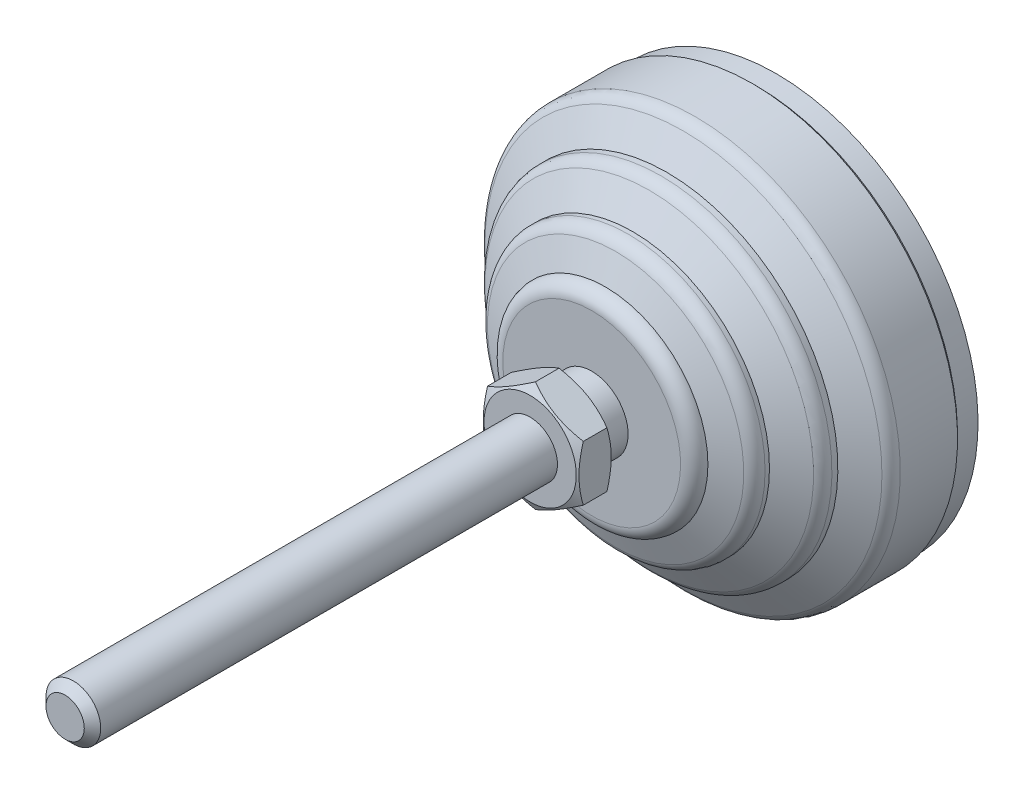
ISO-10303-21;
HEADER;
FILE_DESCRIPTION(('STEP AP214'),'2;1');
FILE_NAME('part.step','',(''),(''),'','','');
FILE_SCHEMA(('AUTOMOTIVE_DESIGN { 1 0 10303 214 1 1 1 1 }'));
ENDSEC;
DATA;
#1=APPLICATION_CONTEXT('core data for automotive mechanical design processes');
#2=APPLICATION_PROTOCOL_DEFINITION('international standard','automotive_design',2000,#1);
#3=PRODUCT_CONTEXT('',#1,'mechanical');
#4=PRODUCT('Part','Part','',(#3));
#5=PRODUCT_RELATED_PRODUCT_CATEGORY('part','',(#4));
#6=PRODUCT_DEFINITION_FORMATION('','',#4);
#7=PRODUCT_DEFINITION_CONTEXT('part definition',#1,'design');
#8=PRODUCT_DEFINITION('design','',#6,#7);
#9=PRODUCT_DEFINITION_SHAPE('','',#8);
#10=(LENGTH_UNIT() NAMED_UNIT(*) SI_UNIT(.MILLI.,.METRE.));
#11=(NAMED_UNIT(*) PLANE_ANGLE_UNIT() SI_UNIT($,.RADIAN.));
#12=(NAMED_UNIT(*) SI_UNIT($,.STERADIAN.) SOLID_ANGLE_UNIT());
#13=UNCERTAINTY_MEASURE_WITH_UNIT(LENGTH_MEASURE(1.E-05),#10,'distance_accuracy_value','');
#14=(GEOMETRIC_REPRESENTATION_CONTEXT(3) GLOBAL_UNCERTAINTY_ASSIGNED_CONTEXT((#13)) GLOBAL_UNIT_ASSIGNED_CONTEXT((#10,
#11,#12)) REPRESENTATION_CONTEXT('',''));
#15=CARTESIAN_POINT('',(0.,0.,0.));
#16=DIRECTION('',(0.,0.,1.));
#17=DIRECTION('',(1.,0.,0.));
#18=AXIS2_PLACEMENT_3D('',#15,#16,#17);
#19=CARTESIAN_POINT('',(-5.32445501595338,0.,31.));
#20=DIRECTION('',(0.,0.,1.));
#21=DIRECTION('',(0.,-1.,0.));
#22=AXIS2_PLACEMENT_3D('',#19,#20,#21);
#23=PLANE('',#22);
#24=CARTESIAN_POINT('',(0.,0.,31.));
#25=DIRECTION('',(0.,0.,-1.));
#26=DIRECTION('',(-1.,0.,0.));
#27=AXIS2_PLACEMENT_3D('',#24,#25,#26);
#28=CIRCLE('',#27,6.75);
#29=CARTESIAN_POINT('',(-6.75,0.,31.));
#30=VERTEX_POINT('',#29);
#31=EDGE_CURVE('E491',#30,#30,#28,.T.);
#32=ORIENTED_EDGE('',*,*,#31,.T.);
#33=EDGE_LOOP('',(#32));
#34=FACE_BOUND('',#33,.T.);
#35=CARTESIAN_POINT('',(0.,0.,31.));
#36=DIRECTION('',(0.,0.,-1.));
#37=DIRECTION('',(0.,1.,0.));
#38=AXIS2_PLACEMENT_3D('',#35,#36,#37);
#39=CIRCLE('',#38,5.32445501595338);
#40=CARTESIAN_POINT('',(0.,5.32445501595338,31.));
#41=VERTEX_POINT('',#40);
#42=EDGE_CURVE('E137',#41,#41,#39,.T.);
#43=ORIENTED_EDGE('',*,*,#42,.F.);
#44=EDGE_LOOP('',(#43));
#45=FACE_BOUND('',#44,.T.);
#46=ADVANCED_FACE('F14',(#34,#45),#23,.F.);
#47=CARTESIAN_POINT('',(0.,0.,0.));
#48=DIRECTION('',(0.,0.,-1.));
#49=DIRECTION('',(0.,1.,0.));
#50=AXIS2_PLACEMENT_3D('',#47,#48,#49);
#51=CYLINDRICAL_SURFACE('',#50,5.32445501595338);
#52=CARTESIAN_POINT('',(0.,0.,27.));
#53=DIRECTION('',(0.,0.,-1.));
#54=DIRECTION('',(0.,1.,0.));
#55=AXIS2_PLACEMENT_3D('',#52,#53,#54);
#56=CIRCLE('',#55,5.32445501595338);
#57=CARTESIAN_POINT('',(0.,5.32445501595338,27.));
#58=VERTEX_POINT('',#57);
#59=EDGE_CURVE('E134',#58,#58,#56,.T.);
#60=ORIENTED_EDGE('',*,*,#59,.F.);
#61=EDGE_LOOP('',(#60));
#62=FACE_BOUND('',#61,.T.);
#63=ORIENTED_EDGE('',*,*,#42,.T.);
#64=EDGE_LOOP('',(#63));
#65=FACE_BOUND('',#64,.T.);
#66=ADVANCED_FACE('F284',(#62,#65),#51,.T.);
#67=CARTESIAN_POINT('',(-13.,0.,27.));
#68=DIRECTION('',(0.,0.,-1.));
#69=DIRECTION('',(0.,1.,0.));
#70=AXIS2_PLACEMENT_3D('',#67,#68,#69);
#71=PLANE('',#70);
#72=CARTESIAN_POINT('',(0.,0.,27.));
#73=DIRECTION('',(0.,0.,-1.));
#74=DIRECTION('',(0.,1.,0.));
#75=AXIS2_PLACEMENT_3D('',#72,#73,#74);
#76=CIRCLE('',#75,13.);
#77=CARTESIAN_POINT('',(0.,13.,27.));
#78=VERTEX_POINT('',#77);
#79=EDGE_CURVE('E131',#78,#78,#76,.T.);
#80=ORIENTED_EDGE('',*,*,#79,.F.);
#81=EDGE_LOOP('',(#80));
#82=FACE_BOUND('',#81,.T.);
#83=ORIENTED_EDGE('',*,*,#59,.T.);
#84=EDGE_LOOP('',(#83));
#85=FACE_BOUND('',#84,.T.);
#86=ADVANCED_FACE('F280',(#82,#85),#71,.F.);
#87=CARTESIAN_POINT('',(0.,0.,25.));
#88=DIRECTION('',(0.,0.,-1.));
#89=DIRECTION('',(0.,1.,0.));
#90=AXIS2_PLACEMENT_3D('',#87,#88,#89);
#91=TOROIDAL_SURFACE('',#90,13.,2.);
#92=CARTESIAN_POINT('',(0.,0.,25.));
#93=DIRECTION('',(0.,0.,-1.));
#94=DIRECTION('',(0.,1.,0.));
#95=AXIS2_PLACEMENT_3D('',#92,#93,#94);
#96=CIRCLE('',#95,15.);
#97=CARTESIAN_POINT('',(0.,15.,25.));
#98=VERTEX_POINT('',#97);
#99=EDGE_CURVE('E128',#98,#98,#96,.T.);
#100=ORIENTED_EDGE('',*,*,#99,.F.);
#101=EDGE_LOOP('',(#100));
#102=FACE_BOUND('',#101,.T.);
#103=ORIENTED_EDGE('',*,*,#79,.T.);
#104=EDGE_LOOP('',(#103));
#105=FACE_BOUND('',#104,.T.);
#106=ADVANCED_FACE('F276',(#102,#105),#91,.T.);
#107=CARTESIAN_POINT('',(0.,0.,25.));
#108=DIRECTION('',(0.,0.,-1.));
#109=DIRECTION('',(0.,1.,0.));
#110=AXIS2_PLACEMENT_3D('',#107,#108,#109);
#111=CONICAL_SURFACE('',#110,15.,1.19028994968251);
#112=CARTESIAN_POINT('',(0.,0.,23.5028874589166));
#113=DIRECTION('',(0.,0.,-1.));
#114=DIRECTION('',(0.,1.,0.));
#115=AXIS2_PLACEMENT_3D('',#112,#113,#114);
#116=CIRCLE('',#115,18.7427813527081);
#117=CARTESIAN_POINT('',(0.,18.7427813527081,23.5028874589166));
#118=VERTEX_POINT('',#117);
#119=EDGE_CURVE('E125',#118,#118,#116,.T.);
#120=ORIENTED_EDGE('',*,*,#119,.F.);
#121=EDGE_LOOP('',(#120));
#122=FACE_BOUND('',#121,.T.);
#123=ORIENTED_EDGE('',*,*,#99,.T.);
#124=EDGE_LOOP('',(#123));
#125=FACE_BOUND('',#124,.T.);
#126=ADVANCED_FACE('F272',(#122,#125),#111,.T.);
#127=CARTESIAN_POINT('',(0.,0.,21.6459340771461));
#128=DIRECTION('',(0.,0.,-1.));
#129=DIRECTION('',(0.,1.,0.));
#130=AXIS2_PLACEMENT_3D('',#127,#128,#129);
#131=TOROIDAL_SURFACE('',#130,18.,2.);
#132=CARTESIAN_POINT('',(0.,0.,21.6459340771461));
#133=DIRECTION('',(0.,0.,-1.));
#134=DIRECTION('',(0.,1.,0.));
#135=AXIS2_PLACEMENT_3D('',#132,#133,#134);
#136=CIRCLE('',#135,20.);
#137=CARTESIAN_POINT('',(0.,20.,21.6459340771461));
#138=VERTEX_POINT('',#137);
#139=EDGE_CURVE('E122',#138,#138,#136,.T.);
#140=ORIENTED_EDGE('',*,*,#139,.F.);
#141=EDGE_LOOP('',(#140));
#142=FACE_BOUND('',#141,.T.);
#143=ORIENTED_EDGE('',*,*,#119,.T.);
#144=EDGE_LOOP('',(#143));
#145=FACE_BOUND('',#144,.T.);
#146=ADVANCED_FACE('F268',(#142,#145),#131,.T.);
#147=CARTESIAN_POINT('',(0.,0.,0.));
#148=DIRECTION('',(0.,0.,-1.));
#149=DIRECTION('',(0.,1.,0.));
#150=AXIS2_PLACEMENT_3D('',#147,#148,#149);
#151=CYLINDRICAL_SURFACE('',#150,20.);
#152=CARTESIAN_POINT('',(0.,0.,21.));
#153=DIRECTION('',(0.,0.,-1.));
#154=DIRECTION('',(0.,1.,0.));
#155=AXIS2_PLACEMENT_3D('',#152,#153,#154);
#156=CIRCLE('',#155,20.);
#157=CARTESIAN_POINT('',(0.,20.,21.));
#158=VERTEX_POINT('',#157);
#159=EDGE_CURVE('E119',#158,#158,#156,.T.);
#160=ORIENTED_EDGE('',*,*,#159,.F.);
#161=EDGE_LOOP('',(#160));
#162=FACE_BOUND('',#161,.T.);
#163=ORIENTED_EDGE('',*,*,#139,.T.);
#164=EDGE_LOOP('',(#163));
#165=FACE_BOUND('',#164,.T.);
#166=ADVANCED_FACE('F264',(#162,#165),#151,.T.);
#167=CARTESIAN_POINT('',(0.,0.,21.));
#168=DIRECTION('',(0.,0.,-1.));
#169=DIRECTION('',(0.,1.,0.));
#170=AXIS2_PLACEMENT_3D('',#167,#168,#169);
#171=CONICAL_SURFACE('',#170,20.,1.0303768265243);
#172=CARTESIAN_POINT('',(0.,0.,18.5826050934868));
#173=DIRECTION('',(0.,0.,-1.));
#174=DIRECTION('',(0.,1.,0.));
#175=AXIS2_PLACEMENT_3D('',#172,#173,#174);
#176=CIRCLE('',#175,24.0289915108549);
#177=CARTESIAN_POINT('',(0.,24.0289915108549,18.5826050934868));
#178=VERTEX_POINT('',#177);
#179=EDGE_CURVE('E116',#178,#178,#176,.T.);
#180=ORIENTED_EDGE('',*,*,#179,.F.);
#181=EDGE_LOOP('',(#180));
#182=FACE_BOUND('',#181,.T.);
#183=ORIENTED_EDGE('',*,*,#159,.T.);
#184=EDGE_LOOP('',(#183));
#185=FACE_BOUND('',#184,.T.);
#186=ADVANCED_FACE('F260',(#182,#185),#171,.T.);
#187=CARTESIAN_POINT('',(0.,0.,16.8676192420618));
#188=DIRECTION('',(0.,0.,-1.));
#189=DIRECTION('',(0.,1.,0.));
#190=AXIS2_PLACEMENT_3D('',#187,#188,#189);
#191=TOROIDAL_SURFACE('',#190,23.,2.);
#192=CARTESIAN_POINT('',(0.,0.,16.8676192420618));
#193=DIRECTION('',(0.,0.,-1.));
#194=DIRECTION('',(0.,1.,0.));
#195=AXIS2_PLACEMENT_3D('',#192,#193,#194);
#196=CIRCLE('',#195,25.);
#197=CARTESIAN_POINT('',(0.,25.,16.8676192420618));
#198=VERTEX_POINT('',#197);
#199=EDGE_CURVE('E113',#198,#198,#196,.T.);
#200=ORIENTED_EDGE('',*,*,#199,.F.);
#201=EDGE_LOOP('',(#200));
#202=FACE_BOUND('',#201,.T.);
#203=ORIENTED_EDGE('',*,*,#179,.T.);
#204=EDGE_LOOP('',(#203));
#205=FACE_BOUND('',#204,.T.);
#206=ADVANCED_FACE('F256',(#202,#205),#191,.T.);
#207=CARTESIAN_POINT('',(0.,0.,0.));
#208=DIRECTION('',(0.,0.,-1.));
#209=DIRECTION('',(0.,1.,0.));
#210=AXIS2_PLACEMENT_3D('',#207,#208,#209);
#211=CYLINDRICAL_SURFACE('',#210,25.);
#212=CARTESIAN_POINT('',(0.,0.,16.));
#213=DIRECTION('',(0.,0.,-1.));
#214=DIRECTION('',(0.,1.,0.));
#215=AXIS2_PLACEMENT_3D('',#212,#213,#214);
#216=CIRCLE('',#215,25.);
#217=CARTESIAN_POINT('',(0.,25.,16.));
#218=VERTEX_POINT('',#217);
#219=EDGE_CURVE('E110',#218,#218,#216,.T.);
#220=ORIENTED_EDGE('',*,*,#219,.F.);
#221=EDGE_LOOP('',(#220));
#222=FACE_BOUND('',#221,.T.);
#223=ORIENTED_EDGE('',*,*,#199,.T.);
#224=EDGE_LOOP('',(#223));
#225=FACE_BOUND('',#224,.T.);
#226=ADVANCED_FACE('F252',(#222,#225),#211,.T.);
#227=CARTESIAN_POINT('',(0.,0.,16.));
#228=DIRECTION('',(0.,0.,-1.));
#229=DIRECTION('',(0.,1.,0.));
#230=AXIS2_PLACEMENT_3D('',#227,#228,#229);
#231=CONICAL_SURFACE('',#230,25.,1.03037682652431);
#232=CARTESIAN_POINT('',(0.,0.,13.5826050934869));
#233=DIRECTION('',(0.,0.,-1.));
#234=DIRECTION('',(0.,1.,0.));
#235=AXIS2_PLACEMENT_3D('',#232,#233,#234);
#236=CIRCLE('',#235,29.028991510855);
#237=CARTESIAN_POINT('',(0.,29.028991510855,13.5826050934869));
#238=VERTEX_POINT('',#237);
#239=EDGE_CURVE('E107',#238,#238,#236,.T.);
#240=ORIENTED_EDGE('',*,*,#239,.F.);
#241=EDGE_LOOP('',(#240));
#242=FACE_BOUND('',#241,.T.);
#243=ORIENTED_EDGE('',*,*,#219,.T.);
#244=EDGE_LOOP('',(#243));
#245=FACE_BOUND('',#244,.T.);
#246=ADVANCED_FACE('F248',(#242,#245),#231,.T.);
#247=CARTESIAN_POINT('',(0.,0.,11.8676192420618));
#248=DIRECTION('',(0.,0.,-1.));
#249=DIRECTION('',(0.,1.,0.));
#250=AXIS2_PLACEMENT_3D('',#247,#248,#249);
#251=TOROIDAL_SURFACE('',#250,28.,2.);
#252=CARTESIAN_POINT('',(0.,0.,11.8676192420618));
#253=DIRECTION('',(0.,0.,-1.));
#254=DIRECTION('',(0.,1.,0.));
#255=AXIS2_PLACEMENT_3D('',#252,#253,#254);
#256=CIRCLE('',#255,30.);
#257=CARTESIAN_POINT('',(0.,30.,11.8676192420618));
#258=VERTEX_POINT('',#257);
#259=EDGE_CURVE('E104',#258,#258,#256,.T.);
#260=ORIENTED_EDGE('',*,*,#259,.F.);
#261=EDGE_LOOP('',(#260));
#262=FACE_BOUND('',#261,.T.);
#263=ORIENTED_EDGE('',*,*,#239,.T.);
#264=EDGE_LOOP('',(#263));
#265=FACE_BOUND('',#264,.T.);
#266=ADVANCED_FACE('F244',(#262,#265),#251,.T.);
#267=CARTESIAN_POINT('',(0.,0.,0.));
#268=DIRECTION('',(0.,0.,-1.));
#269=DIRECTION('',(0.,1.,0.));
#270=AXIS2_PLACEMENT_3D('',#267,#268,#269);
#271=CYLINDRICAL_SURFACE('',#270,30.);
#272=CARTESIAN_POINT('',(0.,0.,3.49999999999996));
#273=DIRECTION('',(0.,0.,-1.));
#274=DIRECTION('',(0.,1.,0.));
#275=AXIS2_PLACEMENT_3D('',#272,#273,#274);
#276=CIRCLE('',#275,30.);
#277=CARTESIAN_POINT('',(0.,30.,3.49999999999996));
#278=VERTEX_POINT('',#277);
#279=EDGE_CURVE('E101',#278,#278,#276,.T.);
#280=ORIENTED_EDGE('',*,*,#279,.F.);
#281=EDGE_LOOP('',(#280));
#282=FACE_BOUND('',#281,.T.);
#283=ORIENTED_EDGE('',*,*,#259,.T.);
#284=EDGE_LOOP('',(#283));
#285=FACE_BOUND('',#284,.T.);
#286=ADVANCED_FACE('F240',(#282,#285),#271,.T.);
#287=CARTESIAN_POINT('',(0.,0.,3.49999999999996));
#288=DIRECTION('',(0.,0.,1.));
#289=DIRECTION('',(0.,-1.,0.));
#290=AXIS2_PLACEMENT_3D('',#287,#288,#289);
#291=CONICAL_SURFACE('',#290,30.,0.785398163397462);
#292=CARTESIAN_POINT('',(0.,0.,3.));
#293=DIRECTION('',(0.,0.,-1.));
#294=DIRECTION('',(0.,1.,0.));
#295=AXIS2_PLACEMENT_3D('',#292,#293,#294);
#296=CIRCLE('',#295,29.5);
#297=CARTESIAN_POINT('',(0.,29.5,3.));
#298=VERTEX_POINT('',#297);
#299=EDGE_CURVE('E98',#298,#298,#296,.T.);
#300=ORIENTED_EDGE('',*,*,#299,.F.);
#301=EDGE_LOOP('',(#300));
#302=FACE_BOUND('',#301,.T.);
#303=ORIENTED_EDGE('',*,*,#279,.T.);
#304=EDGE_LOOP('',(#303));
#305=FACE_BOUND('',#304,.T.);
#306=ADVANCED_FACE('F236',(#302,#305),#291,.T.);
#307=CARTESIAN_POINT('',(0.,0.,0.));
#308=DIRECTION('',(0.,0.,-1.));
#309=DIRECTION('',(0.,1.,0.));
#310=AXIS2_PLACEMENT_3D('',#307,#308,#309);
#311=CYLINDRICAL_SURFACE('',#310,29.5);
#312=CARTESIAN_POINT('',(0.,0.,0.));
#313=DIRECTION('',(0.,0.,-1.));
#314=DIRECTION('',(0.,1.,0.));
#315=AXIS2_PLACEMENT_3D('',#312,#313,#314);
#316=CIRCLE('',#315,29.5);
#317=CARTESIAN_POINT('',(0.,29.5,0.));
#318=VERTEX_POINT('',#317);
#319=EDGE_CURVE('E95',#318,#318,#316,.T.);
#320=ORIENTED_EDGE('',*,*,#319,.F.);
#321=EDGE_LOOP('',(#320));
#322=FACE_BOUND('',#321,.T.);
#323=ORIENTED_EDGE('',*,*,#299,.T.);
#324=EDGE_LOOP('',(#323));
#325=FACE_BOUND('',#324,.T.);
#326=ADVANCED_FACE('F232',(#322,#325),#311,.T.);
#327=CARTESIAN_POINT('',(-29.5,0.,0.));
#328=DIRECTION('',(0.,0.,1.));
#329=DIRECTION('',(0.,-1.,0.));
#330=AXIS2_PLACEMENT_3D('',#327,#328,#329);
#331=PLANE('',#330);
#332=ORIENTED_EDGE('',*,*,#319,.T.);
#333=EDGE_LOOP('',(#332));
#334=FACE_BOUND('',#333,.T.);
#335=ADVANCED_FACE('F228',(#334),#331,.F.);
#336=CARTESIAN_POINT('',(0.,0.,32.5528542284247));
#337=DIRECTION('',(0.,0.,1.));
#338=DIRECTION('',(1.,0.,0.));
#339=AXIS2_PLACEMENT_3D('',#336,#337,#338);
#340=CONICAL_SURFACE('',#339,9.43962242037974,1.04719755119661);
#341=CARTESIAN_POINT('',(0.256048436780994,-8.23073340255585,31.857200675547));
#342=CARTESIAN_POINT('',(-0.0705706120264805,-8.0421598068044,31.7425035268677));
#343=CARTESIAN_POINT('',(-0.400244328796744,-7.85182259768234,31.6375320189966));
#344=CARTESIAN_POINT('',(-1.06596908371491,-7.46746623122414,31.4532528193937));
#345=CARTESIAN_POINT('',(-1.40203697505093,-7.2734373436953,31.3740272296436));
#346=CARTESIAN_POINT('',(-1.90471953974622,-6.98321342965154,31.2806025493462));
#347=CARTESIAN_POINT('',(-2.06958730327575,-6.88802698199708,31.2539163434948));
#348=CARTESIAN_POINT('',(-2.40018534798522,-6.6971561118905,31.2088937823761));
#349=CARTESIAN_POINT('',(-2.56591563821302,-6.60147168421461,31.1905575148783));
#350=CARTESIAN_POINT('',(-2.89766899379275,-6.40993379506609,31.1627580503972));
#351=CARTESIAN_POINT('',(-3.06369115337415,-6.31408085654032,31.1532805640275));
#352=CARTESIAN_POINT('',(-3.39593898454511,-6.1222574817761,31.1434184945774));
#353=CARTESIAN_POINT('',(-3.56216465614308,-6.02628704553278,31.1430339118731));
#354=CARTESIAN_POINT('',(-3.90485505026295,-5.82843465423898,31.1516324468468));
#355=CARTESIAN_POINT('',(-4.08130880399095,-5.7265590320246,31.1612039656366));
#356=CARTESIAN_POINT('',(-4.43359653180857,-5.5231656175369,31.1903212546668));
#357=CARTESIAN_POINT('',(-4.60943048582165,-5.42164783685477,31.2098673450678));
#358=CARTESIAN_POINT('',(-4.96044743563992,-5.21898810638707,31.2583834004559));
#359=CARTESIAN_POINT('',(-5.13562858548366,-5.11784722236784,31.2873710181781));
#360=CARTESIAN_POINT('',(-5.48476055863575,-4.91627578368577,31.3539657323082));
#361=CARTESIAN_POINT('',(-5.65871129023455,-4.81584528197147,31.3915734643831));
#362=CARTESIAN_POINT('',(-6.01075046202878,-4.61259537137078,31.4758335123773));
#363=CARTESIAN_POINT('',(-6.18879364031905,-4.50980209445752,31.5227363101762));
#364=CARTESIAN_POINT('',(-6.54334672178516,-4.30510077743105,31.6237641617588));
#365=CARTESIAN_POINT('',(-6.71985646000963,-4.20319283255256,31.6778899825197));
#366=CARTESIAN_POINT('',(-7.07060906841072,-4.00068571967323,31.7921597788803));
#367=CARTESIAN_POINT('',(-7.24485829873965,-3.90008287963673,31.8522779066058));
#368=CARTESIAN_POINT('',(-7.59183819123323,-3.69975394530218,31.977856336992));
#369=CARTESIAN_POINT('',(-7.76456940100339,-3.60002753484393,32.0433146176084));
#370=CARTESIAN_POINT('',(-7.93661117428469,-3.50069917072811,32.1110354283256));
#371=B_SPLINE_CURVE_WITH_KNOTS('',3,(#341,#342,#343,#344,#345,#346,#347,#348,#349,#350,#351,
#352,#353,#354,#355,#356,#357,#358,#359,#360,#361,#362,#363,#364,#365,#366,#367,#368,#369,#370),
.UNSPECIFIED.,.F.,.F.,(4,2,2,2,2,2,2,2,2,2,2,2,2,2,4),(0.,1.18335133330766,2.37044008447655,
2.94697383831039,3.52351365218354,4.0991218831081,4.67473013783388,5.28640056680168,
5.89809063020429,6.51093099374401,7.12381656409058,7.75627436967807,8.38879938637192,
9.01870525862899,9.6483737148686),.UNSPECIFIED.);
#372=CARTESIAN_POINT('',(0.,-8.08290376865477,31.7695523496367));
#373=VERTEX_POINT('',#372);
#374=CARTESIAN_POINT('',(-7.,-4.04145188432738,31.7695523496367));
#375=VERTEX_POINT('',#374);
#376=EDGE_CURVE('E73',#373,#375,#371,.T.);
#377=ORIENTED_EDGE('',*,*,#376,.T.);
#378=CARTESIAN_POINT('',(-7.,-10.8074057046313,34.537041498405));
#379=CARTESIAN_POINT('',(-7.,-10.5020711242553,34.3891222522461));
#380=CARTESIAN_POINT('',(-7.,-10.1960304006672,34.2426354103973));
#381=CARTESIAN_POINT('',(-7.,-9.58216093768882,33.9533331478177));
#382=CARTESIAN_POINT('',(-7.,-9.27433192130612,33.8105183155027));
#383=CARTESIAN_POINT('',(-7.,-8.65490076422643,33.5286377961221));
#384=CARTESIAN_POINT('',(-7.,-8.34328717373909,33.3895971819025));
#385=CARTESIAN_POINT('',(-7.,-7.71756453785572,33.1172711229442));
#386=CARTESIAN_POINT('',(-7.,-7.40345561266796,32.9839854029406));
#387=CARTESIAN_POINT('',(-7.,-6.76229504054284,32.7206038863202));
#388=CARTESIAN_POINT('',(-7.,-6.43514730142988,32.5907407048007));
#389=CARTESIAN_POINT('',(-7.,-5.77700736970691,32.3409606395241));
#390=CARTESIAN_POINT('',(-7.,-5.44601474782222,32.2210448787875));
#391=CARTESIAN_POINT('',(-7.,-4.78028978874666,31.9943435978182));
#392=CARTESIAN_POINT('',(-7.,-4.44556674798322,31.8875310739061));
#393=CARTESIAN_POINT('',(-7.,-3.77133188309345,31.6904940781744));
#394=CARTESIAN_POINT('',(-7.,-3.43182161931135,31.6002643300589));
#395=CARTESIAN_POINT('',(-7.,-2.74963628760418,31.4412378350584));
#396=CARTESIAN_POINT('',(-7.,-2.4069886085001,31.3723267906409));
#397=CARTESIAN_POINT('',(-7.,-1.88993596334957,31.2879570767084));
#398=CARTESIAN_POINT('',(-7.,-1.71705849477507,31.2629988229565));
#399=CARTESIAN_POINT('',(-7.,-1.37046084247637,31.2199052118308));
#400=CARTESIAN_POINT('',(-7.,-1.196740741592,31.2017691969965));
#401=CARTESIAN_POINT('',(-7.,-0.850938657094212,31.172906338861));
#402=CARTESIAN_POINT('',(-7.,-0.678864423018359,31.1620870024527));
#403=CARTESIAN_POINT('',(-7.,-0.334412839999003,31.1477313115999));
#404=CARTESIAN_POINT('',(-7.,-0.162035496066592,31.1441948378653));
#405=CARTESIAN_POINT('',(-7.,0.182714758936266,31.1444891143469));
#406=CARTESIAN_POINT('',(-7.,0.355087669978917,31.1483199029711));
#407=CARTESIAN_POINT('',(-7.,0.699520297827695,31.1632559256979));
#408=CARTESIAN_POINT('',(-7.,0.871579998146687,31.174361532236));
#409=CARTESIAN_POINT('',(-7.,1.28657100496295,31.2096870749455));
#410=CARTESIAN_POINT('',(-7.,1.529207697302,31.2374407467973));
#411=CARTESIAN_POINT('',(-7.,2.01263683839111,31.3058894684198));
#412=CARTESIAN_POINT('',(-7.,2.2534290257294,31.3465863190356));
#413=CARTESIAN_POINT('',(-7.,2.97278788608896,31.4859299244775));
#414=CARTESIAN_POINT('',(-7.,3.44805944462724,31.6018030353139));
#415=CARTESIAN_POINT('',(-7.,4.15865505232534,31.8021908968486));
#416=CARTESIAN_POINT('',(-7.,4.39767857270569,31.8743367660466));
#417=CARTESIAN_POINT('',(-7.,4.8734031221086,32.0259855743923));
#418=CARTESIAN_POINT('',(-7.,5.11010413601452,32.1054885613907));
#419=CARTESIAN_POINT('',(-7.,5.58126078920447,32.2705873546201));
#420=CARTESIAN_POINT('',(-7.,5.81571717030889,32.3561810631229));
#421=CARTESIAN_POINT('',(-7.,6.28269658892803,32.532467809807));
#422=CARTESIAN_POINT('',(-7.,6.51521964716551,32.6231607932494));
#423=CARTESIAN_POINT('',(-7.,7.05602330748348,32.8398377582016));
#424=CARTESIAN_POINT('',(-7.,7.36363740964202,32.9674819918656));
#425=CARTESIAN_POINT('',(-7.,7.97631827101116,33.2287611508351));
#426=CARTESIAN_POINT('',(-7.,8.28138488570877,33.3623964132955));
#427=CARTESIAN_POINT('',(-7.,8.88942899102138,33.634476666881));
#428=CARTESIAN_POINT('',(-7.,9.19240607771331,33.7729225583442));
#429=CARTESIAN_POINT('',(-7.,9.79656715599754,34.0536797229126));
#430=CARTESIAN_POINT('',(-7.,10.0977511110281,34.1959910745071));
#431=CARTESIAN_POINT('',(-7.,10.6989131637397,34.4839094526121));
#432=CARTESIAN_POINT('',(-7.,10.9988897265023,34.6295196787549));
#433=CARTESIAN_POINT('',(-7.,11.5975656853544,34.9233447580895));
#434=CARTESIAN_POINT('',(-7.,11.8962650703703,35.0715596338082));
#435=CARTESIAN_POINT('',(-7.,12.7906731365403,35.5193927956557));
#436=CARTESIAN_POINT('',(-7.,13.3847669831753,35.8222359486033));
#437=CARTESIAN_POINT('',(-7.,14.5214363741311,36.4090326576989));
#438=CARTESIAN_POINT('',(-7.,15.0642587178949,36.692510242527));
#439=CARTESIAN_POINT('',(-7.,16.1478802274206,37.263346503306));
#440=CARTESIAN_POINT('',(-7.,16.6886793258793,37.5507053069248));
#441=CARTESIAN_POINT('',(-7.,17.7674081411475,38.1276995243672));
#442=CARTESIAN_POINT('',(-7.,18.3053416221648,38.4173279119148));
#443=CARTESIAN_POINT('',(-7.,19.379910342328,38.9989167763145));
#444=CARTESIAN_POINT('',(-7.,19.9165456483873,39.2908771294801));
#445=CARTESIAN_POINT('',(-7.,20.4527008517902,39.5837106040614));
#446=B_SPLINE_CURVE_WITH_KNOTS('',3,(#378,#379,#380,#381,#382,#383,#384,#385,#386,#387,#388,
#389,#390,#391,#392,#393,#394,#395,#396,#397,#398,#399,#400,#401,#402,#403,#404,#405,#406,#407,
#408,#409,#410,#411,#412,#413,#414,#415,#416,#417,#418,#419,#420,#421,#422,#423,#424,#425,#426,
#427,#428,#429,#430,#431,#432,#433,#434,#435,#436,#437,#438,#439,#440,#441,#442,#443,#444,#445),
.UNSPECIFIED.,.F.,.F.,(4,2,2,2,2,2,2,2,2,2,2,2,2,2,2,2,2,2,2,2,2,2,2,2,2,2,2,2,2,2,2,2,2,4),(0.,
1.01784555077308,2.03585320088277,3.05948521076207,4.08306820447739,5.13888343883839,
6.19481770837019,7.24853794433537,8.30192232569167,9.34955712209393,9.87345301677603,
10.3972984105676,10.9143912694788,11.4314756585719,11.9485627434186,12.4656763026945,
13.1979179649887,13.930261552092,15.3957810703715,16.144743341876,16.8937104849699,
17.6424209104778,18.3911233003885,19.3901759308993,20.3892848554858,21.3885817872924,
22.3878990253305,23.3882309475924,24.3885715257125,26.3890020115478,28.2261408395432,
30.063340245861,31.8961770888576,33.7289173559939),.UNSPECIFIED.);
#447=CARTESIAN_POINT('',(-7.,4.04145188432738,31.7695523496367));
#448=VERTEX_POINT('',#447);
#449=EDGE_CURVE('E81',#375,#448,#446,.T.);
#450=ORIENTED_EDGE('',*,*,#449,.T.);
#451=CARTESIAN_POINT('',(-12.6949480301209,0.753472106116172,34.4452155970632));
#452=CARTESIAN_POINT('',(-12.4260631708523,0.908712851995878,34.2956041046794));
#453=CARTESIAN_POINT('',(-12.1565247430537,1.06433093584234,34.1475288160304));
#454=CARTESIAN_POINT('',(-11.6157796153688,1.37653028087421,33.8553468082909));
#455=CARTESIAN_POINT('',(-11.3445726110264,1.53311171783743,33.7112408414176));
#456=CARTESIAN_POINT('',(-10.7985111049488,1.84838047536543,33.4270560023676));
#457=CARTESIAN_POINT('',(-10.5236443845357,2.00707485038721,33.2870083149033));
#458=CARTESIAN_POINT('',(-9.97157335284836,2.32581320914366,33.0132227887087));
#459=CARTESIAN_POINT('',(-9.69436917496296,2.48585711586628,32.8794845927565));
#460=CARTESIAN_POINT('',(-9.13456378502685,2.8090609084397,32.6188339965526));
#461=CARTESIAN_POINT('',(-8.85193636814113,2.97223592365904,32.4919961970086));
#462=CARTESIAN_POINT('',(-8.28324434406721,3.30057041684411,32.2488359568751));
#463=CARTESIAN_POINT('',(-7.99717932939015,3.46573013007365,32.1325147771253));
#464=CARTESIAN_POINT('',(-7.421816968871,3.79791574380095,31.9137511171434));
#465=CARTESIAN_POINT('',(-7.13252909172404,3.96493617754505,31.8112758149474));
#466=CARTESIAN_POINT('',(-6.54979946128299,4.30137528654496,31.62376095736));
#467=CARTESIAN_POINT('',(-6.25635918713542,4.47079310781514,31.5387153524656));
#468=CARTESIAN_POINT('',(-5.66991951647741,4.80937420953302,31.3916877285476));
#469=CARTESIAN_POINT('',(-5.37698656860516,4.97849912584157,31.3293621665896));
#470=CARTESIAN_POINT('',(-4.93518094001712,5.23357572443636,31.2549603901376));
#471=CARTESIAN_POINT('',(-4.78749185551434,5.31884405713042,31.2333393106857));
#472=CARTESIAN_POINT('',(-4.49149110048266,5.48974017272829,31.1968878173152));
#473=CARTESIAN_POINT('',(-4.34317948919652,5.57536792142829,31.1820567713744));
#474=CARTESIAN_POINT('',(-4.0469805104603,5.74637848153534,31.1595760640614));
#475=CARTESIAN_POINT('',(-3.89909541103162,5.83175998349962,31.1518866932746));
#476=CARTESIAN_POINT('',(-3.60317680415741,6.00260867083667,31.1437212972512));
#477=CARTESIAN_POINT('',(-3.4551432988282,6.08807585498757,31.1432451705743));
#478=CARTESIAN_POINT('',(-3.15922834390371,6.25892243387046,31.1495173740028));
#479=CARTESIAN_POINT('',(-3.01134686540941,6.3443018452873,31.1562638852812));
#480=CARTESIAN_POINT('',(-2.71595034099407,6.51484910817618,31.1768214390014));
#481=CARTESIAN_POINT('',(-2.56843531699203,6.60001694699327,31.1906328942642));
#482=CARTESIAN_POINT('',(-2.20452365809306,6.81012144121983,31.2331420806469));
#483=CARTESIAN_POINT('',(-1.988466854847,6.9348618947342,31.2657888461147));
#484=CARTESIAN_POINT('',(-1.5581802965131,7.18328795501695,31.3443635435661));
#485=CARTESIAN_POINT('',(-1.34395084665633,7.3069733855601,31.3902936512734));
#486=CARTESIAN_POINT('',(-0.703562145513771,7.67670197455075,31.5456866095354));
#487=CARTESIAN_POINT('',(-0.280556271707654,7.92092452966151,31.6726401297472));
#488=CARTESIAN_POINT('',(0.351843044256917,8.28604044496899,31.8895846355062));
#489=CARTESIAN_POINT('',(0.564578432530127,8.40886327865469,31.9673083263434));
#490=CARTESIAN_POINT('',(0.987995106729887,8.65332300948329,32.1300198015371));
#491=CARTESIAN_POINT('',(1.19867621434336,8.7749598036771,32.2150082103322));
#492=CARTESIAN_POINT('',(1.61692752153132,9.01643730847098,32.390465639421));
#493=CARTESIAN_POINT('',(1.82450865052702,9.13628432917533,32.4809002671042));
#494=CARTESIAN_POINT('',(2.23793636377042,9.37497693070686,32.6666907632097));
#495=CARTESIAN_POINT('',(2.4437835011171,9.49382283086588,32.7620449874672));
#496=CARTESIAN_POINT('',(2.64890562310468,9.61225014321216,32.8593908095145));
#497=B_SPLINE_CURVE_WITH_KNOTS('',3,(#451,#452,#453,#454,#455,#456,#457,#458,#459,#460,#461,
#462,#463,#464,#465,#466,#467,#468,#469,#470,#471,#472,#473,#474,#475,#476,#477,#478,#479,#480,
#481,#482,#483,#484,#485,#486,#487,#488,#489,#490,#491,#492,#493,#494,#495,#496),.UNSPECIFIED.,
.F.,.F.,(4,2,2,2,2,2,2,2,2,2,2,2,2,2,2,2,2,2,2,2,2,2,4),(0.,1.03395967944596,2.06811397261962,
3.10880014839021,4.14942733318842,5.19968245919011,6.25006333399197,7.29790885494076,
8.34539007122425,9.37630211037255,9.89189324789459,10.4074363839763,10.9200955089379,
11.4327474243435,11.9452702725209,12.4578230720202,13.2122131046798,13.9667267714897,
15.4787174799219,16.2516097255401,17.0245684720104,17.7930744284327,18.5613251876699),.UNSPECIFIED.);
#498=CARTESIAN_POINT('',(0.,8.08290376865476,31.7695523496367));
#499=VERTEX_POINT('',#498);
#500=EDGE_CURVE('E215',#448,#499,#497,.T.);
#501=ORIENTED_EDGE('',*,*,#500,.T.);
#502=CARTESIAN_POINT('',(-0.943534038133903,8.62765339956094,32.113762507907));
#503=CARTESIAN_POINT('',(-0.771393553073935,8.52826804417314,32.0459340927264));
#504=CARTESIAN_POINT('',(-0.59856347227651,8.42848455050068,31.98036648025));
#505=CARTESIAN_POINT('',(-0.2513848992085,8.22804090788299,31.8545663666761));
#506=CARTESIAN_POINT('',(-0.0770358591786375,8.1273804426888,31.7943358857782));
#507=CARTESIAN_POINT('',(0.273919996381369,7.92475598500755,31.679837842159));
#508=CARTESIAN_POINT('',(0.450533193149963,7.82278830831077,31.6255961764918));
#509=CARTESIAN_POINT('',(0.805295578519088,7.61796614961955,31.5243353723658));
#510=CARTESIAN_POINT('',(0.983444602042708,7.51511176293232,31.4773154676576));
#511=CARTESIAN_POINT('',(1.33569201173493,7.31174162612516,31.3928262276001));
#512=CARTESIAN_POINT('',(1.50974500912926,7.21125208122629,31.3551062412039));
#513=CARTESIAN_POINT('',(1.85908525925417,7.0095603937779,31.2882896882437));
#514=CARTESIAN_POINT('',(2.03437241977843,6.90835830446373,31.2591924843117));
#515=CARTESIAN_POINT('',(2.38560506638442,6.70557404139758,31.2104632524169));
#516=CARTESIAN_POINT('',(2.5615486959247,6.6039929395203,31.190813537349));
#517=CARTESIAN_POINT('',(2.91406015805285,6.40047035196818,31.1614981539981));
#518=CARTESIAN_POINT('',(3.09062797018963,6.29852887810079,31.1518321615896));
#519=CARTESIAN_POINT('',(3.43334919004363,6.10065868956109,31.1430673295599));
#520=CARTESIAN_POINT('',(3.59949120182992,6.00473655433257,31.1433687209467));
#521=CARTESIAN_POINT('',(3.93157537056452,5.81300767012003,31.1530565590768));
#522=CARTESIAN_POINT('',(4.09751752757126,5.71720092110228,31.1624430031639));
#523=CARTESIAN_POINT('',(4.42911404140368,5.5257535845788,31.190055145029));
#524=CARTESIAN_POINT('',(4.59476750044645,5.43011351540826,31.2082950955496));
#525=CARTESIAN_POINT('',(4.92521546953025,5.23932929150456,31.253122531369));
#526=CARTESIAN_POINT('',(5.09000998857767,5.14418513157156,31.2797099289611));
#527=CARTESIAN_POINT('',(5.59246501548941,4.85409258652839,31.3728309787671));
#528=CARTESIAN_POINT('',(5.92838368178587,4.6601498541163,31.4518511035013));
#529=CARTESIAN_POINT('',(6.59382141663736,4.27595919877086,31.6357306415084));
#530=CARTESIAN_POINT('',(6.92335725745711,4.08570159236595,31.740508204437));
#531=CARTESIAN_POINT('',(7.24983912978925,3.89720719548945,31.8550217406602));
#532=B_SPLINE_CURVE_WITH_KNOTS('',3,(#502,#503,#504,#505,#506,#507,#508,#509,#510,#511,#512,
#513,#514,#515,#516,#517,#518,#519,#520,#521,#522,#523,#524,#525,#526,#527,#528,#529,#530,#531),
.UNSPECIFIED.,.F.,.F.,(4,2,2,2,2,2,2,2,2,2,2,2,2,2,4),(0.,0.630096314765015,1.26043012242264,
1.89339089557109,2.52628446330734,3.13958030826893,3.75283080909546,4.36492869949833,
4.97700671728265,5.55232508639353,6.12764328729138,6.703890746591,7.28013215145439,
8.46659031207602,9.64932588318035),.UNSPECIFIED.);
#533=CARTESIAN_POINT('',(7.,4.04145188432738,31.7695523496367));
#534=VERTEX_POINT('',#533);
#535=EDGE_CURVE('E481',#499,#534,#532,.T.);
#536=ORIENTED_EDGE('',*,*,#535,.T.);
#537=CARTESIAN_POINT('',(7.,-10.8074057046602,34.537041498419));
#538=CARTESIAN_POINT('',(7.,-10.5020711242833,34.3891222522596));
#539=CARTESIAN_POINT('',(7.,-10.1960304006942,34.2426354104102));
#540=CARTESIAN_POINT('',(7.,-9.58216093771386,33.9533331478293));
#541=CARTESIAN_POINT('',(7.,-9.27433192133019,33.8105183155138));
#542=CARTESIAN_POINT('',(7.,-8.65490076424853,33.528637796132));
#543=CARTESIAN_POINT('',(7.,-8.34328717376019,33.3895971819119));
#544=CARTESIAN_POINT('',(7.,-7.71756453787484,33.1172711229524));
#545=CARTESIAN_POINT('',(7.,-7.40345561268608,32.9839854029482));
#546=CARTESIAN_POINT('',(7.,-6.76229504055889,32.7206038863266));
#547=CARTESIAN_POINT('',(7.,-6.43514730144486,32.5907407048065));
#548=CARTESIAN_POINT('',(7.,-5.77700736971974,32.3409606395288));
#549=CARTESIAN_POINT('',(7.,-5.44601474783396,32.2210448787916));
#550=CARTESIAN_POINT('',(7.,-4.7802897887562,31.9943435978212));
#551=CARTESIAN_POINT('',(7.,-4.44556674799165,31.8875310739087));
#552=CARTESIAN_POINT('',(7.,-3.77133188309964,31.6904940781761));
#553=CARTESIAN_POINT('',(7.,-3.4318216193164,31.6002643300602));
#554=CARTESIAN_POINT('',(7.,-2.74963628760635,31.4412378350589));
#555=CARTESIAN_POINT('',(7.,-2.40698860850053,31.372326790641));
#556=CARTESIAN_POINT('',(7.,-1.88993596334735,31.287957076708));
#557=CARTESIAN_POINT('',(7.,-1.71705849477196,31.262998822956));
#558=CARTESIAN_POINT('',(7.,-1.37046084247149,31.2199052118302));
#559=CARTESIAN_POINT('',(7.,-1.19674074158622,31.2017691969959));
#560=CARTESIAN_POINT('',(7.,-0.850938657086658,31.1729063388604));
#561=CARTESIAN_POINT('',(7.,-0.678864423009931,31.1620870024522));
#562=CARTESIAN_POINT('',(7.,-0.334412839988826,31.1477313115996));
#563=CARTESIAN_POINT('',(7.,-0.162035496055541,31.1441948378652));
#564=CARTESIAN_POINT('',(7.,0.182714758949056,31.1444891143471));
#565=CARTESIAN_POINT('',(7.,0.355087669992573,31.1483199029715));
#566=CARTESIAN_POINT('',(7.,0.699520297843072,31.1632559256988));
#567=CARTESIAN_POINT('',(7.,0.871579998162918,31.1743615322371));
#568=CARTESIAN_POINT('',(7.,1.28657100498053,31.2096870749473));
#569=CARTESIAN_POINT('',(7.,1.52920769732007,31.2374407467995));
#570=CARTESIAN_POINT('',(7.,2.01263683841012,31.3058894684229));
#571=CARTESIAN_POINT('',(7.,2.25342902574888,31.346586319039));
#572=CARTESIAN_POINT('',(7.,2.97278788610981,31.4859299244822));
#573=CARTESIAN_POINT('',(7.,3.44805944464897,31.6018030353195));
#574=CARTESIAN_POINT('',(7.,4.1586550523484,31.8021908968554));
#575=CARTESIAN_POINT('',(7.,4.39767857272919,31.8743367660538));
#576=CARTESIAN_POINT('',(7.,4.87340312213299,32.0259855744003));
#577=CARTESIAN_POINT('',(7.,5.11010413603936,32.1054885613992));
#578=CARTESIAN_POINT('',(7.,5.58126078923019,32.2705873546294));
#579=CARTESIAN_POINT('',(7.,5.81571717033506,32.3561810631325));
#580=CARTESIAN_POINT('',(7.,6.28269658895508,32.5324678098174));
#581=CARTESIAN_POINT('',(7.,6.51521964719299,32.6231607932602));
#582=CARTESIAN_POINT('',(7.,7.05602330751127,32.839837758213));
#583=CARTESIAN_POINT('',(7.,7.3636374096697,32.9674819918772));
#584=CARTESIAN_POINT('',(7.,7.97631827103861,33.228761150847));
#585=CARTESIAN_POINT('',(7.,8.28138488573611,33.3623964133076));
#586=CARTESIAN_POINT('',(7.,8.88942899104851,33.6344766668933));
#587=CARTESIAN_POINT('',(7.,9.19240607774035,33.7729225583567));
#588=CARTESIAN_POINT('',(7.,9.79656715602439,34.0536797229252));
#589=CARTESIAN_POINT('',(7.,10.0977511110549,34.1959910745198));
#590=CARTESIAN_POINT('',(7.,10.6989131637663,34.4839094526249));
#591=CARTESIAN_POINT('',(7.,10.9988897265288,34.6295196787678));
#592=CARTESIAN_POINT('',(7.,11.5975656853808,34.9233447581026));
#593=CARTESIAN_POINT('',(7.,11.8962650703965,35.0715596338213));
#594=CARTESIAN_POINT('',(7.,12.7906731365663,35.5193927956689));
#595=CARTESIAN_POINT('',(7.,13.3847669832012,35.8222359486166));
#596=CARTESIAN_POINT('',(7.,14.5214363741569,36.4090326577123));
#597=CARTESIAN_POINT('',(7.,15.0642587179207,36.6925102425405));
#598=CARTESIAN_POINT('',(7.,16.1478802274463,37.2633465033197));
#599=CARTESIAN_POINT('',(7.,16.688679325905,37.5507053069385));
#600=CARTESIAN_POINT('',(7.,17.7674081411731,38.127699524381));
#601=CARTESIAN_POINT('',(7.,18.3053416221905,38.4173279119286));
#602=CARTESIAN_POINT('',(7.,19.3799103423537,38.9989167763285));
#603=CARTESIAN_POINT('',(7.,19.916545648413,39.2908771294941));
#604=CARTESIAN_POINT('',(7.,20.4527008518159,39.5837106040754));
#605=B_SPLINE_CURVE_WITH_KNOTS('',3,(#537,#538,#539,#540,#541,#542,#543,#544,#545,#546,#547,
#548,#549,#550,#551,#552,#553,#554,#555,#556,#557,#558,#559,#560,#561,#562,#563,#564,#565,#566,
#567,#568,#569,#570,#571,#572,#573,#574,#575,#576,#577,#578,#579,#580,#581,#582,#583,#584,#585,
#586,#587,#588,#589,#590,#591,#592,#593,#594,#595,#596,#597,#598,#599,#600,#601,#602,#603,#604),
.UNSPECIFIED.,.F.,.F.,(4,2,2,2,2,2,2,2,2,2,2,2,2,2,2,2,2,2,2,2,2,2,2,2,2,2,2,2,2,2,2,2,2,4),(0.,
1.01784555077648,2.03585320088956,3.05948521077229,4.08306820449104,5.13888343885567,
6.19481770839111,7.24853794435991,8.30192232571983,9.34955712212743,9.87345301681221,
10.3972984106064,10.9143912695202,11.4314756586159,11.9485627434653,12.4656763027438,
13.1979179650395,13.9302615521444,15.3957810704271,16.1447433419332,16.8937104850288,
17.6424209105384,18.3911233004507,19.3901759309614,20.3892848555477,21.3885817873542,
22.3878990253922,23.388230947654,24.3885715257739,26.389002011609,28.2261408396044,
30.0633402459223,31.896177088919,33.7289173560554),.UNSPECIFIED.);
#606=CARTESIAN_POINT('',(7.,-4.04145188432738,31.7695523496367));
#607=VERTEX_POINT('',#606);
#608=EDGE_CURVE('E34',#534,#607,#605,.F.);
#609=ORIENTED_EDGE('',*,*,#608,.T.);
#610=CARTESIAN_POINT('',(-5.70014855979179,-11.3738860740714,34.4481103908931));
#611=CARTESIAN_POINT('',(-5.43129741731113,-11.2186647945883,34.298491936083));
#612=CARTESIAN_POINT('',(-5.1617935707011,-11.0630666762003,34.1504074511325));
#613=CARTESIAN_POINT('',(-4.62111999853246,-10.750908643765,33.8582007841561));
#614=CARTESIAN_POINT('',(-4.34994996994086,-10.5943485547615,33.7140793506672));
#615=CARTESIAN_POINT('',(-3.80397089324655,-10.2791273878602,33.4298580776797));
#616=CARTESIAN_POINT('',(-3.52914968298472,-10.1204592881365,33.2897892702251));
#617=CARTESIAN_POINT('',(-2.97717306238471,-9.80177543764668,33.015950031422));
#618=CARTESIAN_POINT('',(-2.70001778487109,-9.64175976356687,32.88217924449));
#619=CARTESIAN_POINT('',(-2.14027908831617,-9.31859447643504,32.6214311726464));
#620=CARTESIAN_POINT('',(-1.85766913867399,-9.15542954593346,32.4945293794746));
#621=CARTESIAN_POINT('',(-1.28901568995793,-8.82711732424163,32.2512232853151));
#622=CARTESIAN_POINT('',(-1.00297178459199,-8.66196979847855,32.1348202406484));
#623=CARTESIAN_POINT('',(-0.427652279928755,-8.3298089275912,31.9158690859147));
#624=CARTESIAN_POINT('',(-0.138386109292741,-8.16280102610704,31.8132883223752));
#625=CARTESIAN_POINT('',(0.444299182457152,-7.8263875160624,31.62553477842));
#626=CARTESIAN_POINT('',(0.737716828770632,-7.65698275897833,31.5403559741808));
#627=CARTESIAN_POINT('',(1.3242097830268,-7.31837089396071,31.3930100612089));
#628=CARTESIAN_POINT('',(1.6172199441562,-7.14920139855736,31.3305068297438));
#629=CARTESIAN_POINT('',(2.05914886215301,-6.89405361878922,31.2558330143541));
#630=CARTESIAN_POINT('',(2.20688023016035,-6.80876087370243,31.2341203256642));
#631=CARTESIAN_POINT('',(2.50296850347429,-6.63781422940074,31.1974854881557));
#632=CARTESIAN_POINT('',(2.65132534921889,-6.55216036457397,31.1825627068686));
#633=CARTESIAN_POINT('',(2.94761330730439,-6.38109843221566,31.1599011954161));
#634=CARTESIAN_POINT('',(3.0955421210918,-6.2956916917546,31.152122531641));
#635=CARTESIAN_POINT('',(3.39155140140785,-6.12479065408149,31.1437820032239));
#636=CARTESIAN_POINT('',(3.53963186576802,-6.03929635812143,31.143220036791));
#637=CARTESIAN_POINT('',(3.83564358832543,-5.86839391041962,31.1493260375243));
#638=CARTESIAN_POINT('',(3.98357487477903,-5.78298574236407,31.1559921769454));
#639=CARTESIAN_POINT('',(4.27907351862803,-5.61237952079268,31.1763961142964));
#640=CARTESIAN_POINT('',(4.42664085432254,-5.52718147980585,31.1901343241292));
#641=CARTESIAN_POINT('',(4.79042304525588,-5.3171517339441,31.2324424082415));
#642=CARTESIAN_POINT('',(5.00630067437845,-5.19251472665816,31.2649485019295));
#643=CARTESIAN_POINT('',(5.43623554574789,-4.94429171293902,31.3432313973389));
#644=CARTESIAN_POINT('',(5.65029248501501,-4.82070588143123,31.3890103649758));
#645=CARTESIAN_POINT('',(6.29017061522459,-4.45127207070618,31.5439425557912));
#646=CARTESIAN_POINT('',(6.71284673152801,-4.20723990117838,31.6705797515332));
#647=CARTESIAN_POINT('',(7.34476752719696,-3.84240025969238,31.8870563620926));
#648=CARTESIAN_POINT('',(7.55735028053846,-3.7196655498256,31.9646260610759));
#649=CARTESIAN_POINT('',(7.98046303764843,-3.47538128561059,32.1270332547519));
#650=CARTESIAN_POINT('',(8.19099286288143,-3.35383183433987,32.2118713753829));
#651=CARTESIAN_POINT('',(8.60894391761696,-3.11252768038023,32.3870336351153));
#652=CARTESIAN_POINT('',(8.81637606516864,-2.99276667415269,32.477323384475));
#653=CARTESIAN_POINT('',(9.22950576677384,-2.75424612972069,32.6628281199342));
#654=CARTESIAN_POINT('',(9.43520387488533,-2.63548627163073,32.7580414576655));
#655=CARTESIAN_POINT('',(9.64017675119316,-2.51714512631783,32.8552483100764));
#656=B_SPLINE_CURVE_WITH_KNOTS('',3,(#610,#611,#612,#613,#614,#615,#616,#617,#618,#619,#620,
#621,#622,#623,#624,#625,#626,#627,#628,#629,#630,#631,#632,#633,#634,#635,#636,#637,#638,#639,
#640,#641,#642,#643,#644,#645,#646,#647,#648,#649,#650,#651,#652,#653,#654,#655),.UNSPECIFIED.,
.F.,.F.,(4,2,2,2,2,2,2,2,2,2,2,2,2,2,2,2,2,2,2,2,2,2,4),(0.,1.03386347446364,2.0679209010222,
3.10848860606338,4.14899749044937,5.19926623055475,6.24966048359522,7.29752809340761,
8.34503235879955,9.37630515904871,9.89207628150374,10.4077993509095,10.9206218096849,
11.4334370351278,11.9461226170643,12.4588380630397,13.2125585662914,13.9664021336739,
15.4770478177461,16.2492964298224,17.0216116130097,17.7894811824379,18.5570953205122),.UNSPECIFIED.);
#657=EDGE_CURVE('E9',#607,#373,#656,.F.);
#658=ORIENTED_EDGE('',*,*,#657,.T.);
#659=EDGE_LOOP('',(#377,#450,#501,#536,#609,#658));
#660=FACE_BOUND('',#659,.T.);
#661=ORIENTED_EDGE('',*,*,#31,.F.);
#662=EDGE_LOOP('',(#661));
#663=FACE_BOUND('',#662,.T.);
#664=ADVANCED_FACE('F71',(#660,#663),#340,.T.);
#665=CARTESIAN_POINT('',(-2.62445501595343,0.,104.));
#666=DIRECTION('',(0.,0.,-1.));
#667=DIRECTION('',(0.,1.,0.));
#668=AXIS2_PLACEMENT_3D('',#665,#666,#667);
#669=PLANE('',#668);
#670=CARTESIAN_POINT('',(0.,0.,104.));
#671=DIRECTION('',(0.,0.,-1.));
#672=DIRECTION('',(0.,1.,0.));
#673=AXIS2_PLACEMENT_3D('',#670,#671,#672);
#674=CIRCLE('',#673,2.8);
#675=CARTESIAN_POINT('',(0.,2.8,104.));
#676=VERTEX_POINT('',#675);
#677=EDGE_CURVE('E143',#676,#676,#674,.F.);
#678=ORIENTED_EDGE('',*,*,#677,.T.);
#679=EDGE_LOOP('',(#678));
#680=FACE_BOUND('',#679,.T.);
#681=ADVANCED_FACE('F294',(#680),#669,.F.);
#682=CARTESIAN_POINT('',(0.,0.,104.));
#683=DIRECTION('',(0.,0.,-1.));
#684=DIRECTION('',(0.,1.,0.));
#685=AXIS2_PLACEMENT_3D('',#682,#683,#684);
#686=CONICAL_SURFACE('',#685,2.8,0.785398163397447);
#687=CARTESIAN_POINT('',(0.,0.,102.8));
#688=DIRECTION('',(0.,0.,-1.));
#689=DIRECTION('',(0.,1.,0.));
#690=AXIS2_PLACEMENT_3D('',#687,#688,#689);
#691=CIRCLE('',#690,4.);
#692=CARTESIAN_POINT('',(0.,4.,102.8));
#693=VERTEX_POINT('',#692);
#694=EDGE_CURVE('E146',#693,#693,#691,.T.);
#695=ORIENTED_EDGE('',*,*,#694,.F.);
#696=EDGE_LOOP('',(#695));
#697=FACE_BOUND('',#696,.T.);
#698=ORIENTED_EDGE('',*,*,#677,.F.);
#699=EDGE_LOOP('',(#698));
#700=FACE_BOUND('',#699,.T.);
#701=ADVANCED_FACE('F16',(#697,#700),#686,.T.);
#702=CARTESIAN_POINT('',(0.,0.,104.));
#703=DIRECTION('',(0.,0.,-1.));
#704=DIRECTION('',(0.,1.,0.));
#705=AXIS2_PLACEMENT_3D('',#702,#703,#704);
#706=CYLINDRICAL_SURFACE('',#705,4.);
#707=ORIENTED_EDGE('',*,*,#694,.T.);
#708=EDGE_LOOP('',(#707));
#709=FACE_BOUND('',#708,.T.);
#710=CARTESIAN_POINT('',(0.,0.,36.));
#711=DIRECTION('',(0.,0.,-1.));
#712=DIRECTION('',(0.,1.,0.));
#713=AXIS2_PLACEMENT_3D('',#710,#711,#712);
#714=CIRCLE('',#713,4.);
#715=CARTESIAN_POINT('',(0.,4.,36.));
#716=VERTEX_POINT('',#715);
#717=EDGE_CURVE('E140',#716,#716,#714,.F.);
#718=ORIENTED_EDGE('',*,*,#717,.T.);
#719=EDGE_LOOP('',(#718));
#720=FACE_BOUND('',#719,.T.);
#721=ADVANCED_FACE('F163',(#709,#720),#706,.T.);
#722=CARTESIAN_POINT('',(-3.82445501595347,0.,36.));
#723=DIRECTION('',(0.,0.,-1.));
#724=DIRECTION('',(0.,1.,0.));
#725=AXIS2_PLACEMENT_3D('',#722,#723,#724);
#726=PLANE('',#725);
#727=CARTESIAN_POINT('',(0.,0.,36.));
#728=DIRECTION('',(0.,0.,-1.));
#729=DIRECTION('',(-1.,0.,0.));
#730=AXIS2_PLACEMENT_3D('',#727,#728,#729);
#731=CIRCLE('',#730,6.75);
#732=CARTESIAN_POINT('',(-6.75,0.,36.));
#733=VERTEX_POINT('',#732);
#734=EDGE_CURVE('E80',#733,#733,#731,.T.);
#735=ORIENTED_EDGE('',*,*,#734,.F.);
#736=EDGE_LOOP('',(#735));
#737=FACE_BOUND('',#736,.T.);
#738=ORIENTED_EDGE('',*,*,#717,.F.);
#739=EDGE_LOOP('',(#738));
#740=FACE_BOUND('',#739,.T.);
#741=ADVANCED_FACE('F160',(#737,#740),#726,.F.);
#742=CARTESIAN_POINT('',(0.,0.,36.));
#743=DIRECTION('',(0.,0.,-1.));
#744=DIRECTION('',(-1.,0.,0.));
#745=AXIS2_PLACEMENT_3D('',#742,#743,#744);
#746=CONICAL_SURFACE('',#745,6.75,1.0471975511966);
#747=CARTESIAN_POINT('',(-7.93661117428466,-3.50069917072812,34.8889645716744));
#748=CARTESIAN_POINT('',(-7.76456940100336,-3.60002753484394,34.9566853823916));
#749=CARTESIAN_POINT('',(-7.59183819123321,-3.69975394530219,35.0221436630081));
#750=CARTESIAN_POINT('',(-7.24485829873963,-3.90008287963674,35.1477220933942));
#751=CARTESIAN_POINT('',(-7.0706090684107,-4.00068571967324,35.2078402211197));
#752=CARTESIAN_POINT('',(-6.71985646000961,-4.20319283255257,35.3221100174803));
#753=CARTESIAN_POINT('',(-6.54334672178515,-4.30510077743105,35.3762358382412));
#754=CARTESIAN_POINT('',(-6.18879364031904,-4.50980209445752,35.4772636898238));
#755=CARTESIAN_POINT('',(-6.01075046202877,-4.61259537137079,35.5241664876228));
#756=CARTESIAN_POINT('',(-5.65871129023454,-4.81584528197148,35.6084265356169));
#757=CARTESIAN_POINT('',(-5.48476055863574,-4.91627578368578,35.6460342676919));
#758=CARTESIAN_POINT('',(-5.13562858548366,-5.11784722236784,35.7126289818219));
#759=CARTESIAN_POINT('',(-4.96044743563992,-5.21898810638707,35.7416165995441));
#760=CARTESIAN_POINT('',(-4.60943048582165,-5.42164783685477,35.7901326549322));
#761=CARTESIAN_POINT('',(-4.43359653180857,-5.5231656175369,35.8096787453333));
#762=CARTESIAN_POINT('',(-4.08130880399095,-5.7265590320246,35.8387960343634));
#763=CARTESIAN_POINT('',(-3.90485505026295,-5.82843465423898,35.8483675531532));
#764=CARTESIAN_POINT('',(-3.56216465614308,-6.02628704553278,35.8569660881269));
#765=CARTESIAN_POINT('',(-3.39593898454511,-6.1222574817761,35.8565815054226));
#766=CARTESIAN_POINT('',(-3.06369115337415,-6.31408085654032,35.8467194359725));
#767=CARTESIAN_POINT('',(-2.89766899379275,-6.40993379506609,35.8372419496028));
#768=CARTESIAN_POINT('',(-2.56591563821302,-6.60147168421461,35.8094424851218));
#769=CARTESIAN_POINT('',(-2.40018534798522,-6.6971561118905,35.791106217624));
#770=CARTESIAN_POINT('',(-2.06958730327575,-6.88802698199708,35.7460836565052));
#771=CARTESIAN_POINT('',(-1.90471953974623,-6.98321342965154,35.7193974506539));
#772=CARTESIAN_POINT('',(-1.40203697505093,-7.2734373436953,35.6259727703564));
#773=CARTESIAN_POINT('',(-1.06596908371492,-7.46746623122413,35.5467471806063));
#774=CARTESIAN_POINT('',(-0.400244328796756,-7.85182259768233,35.3624679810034));
#775=CARTESIAN_POINT('',(-0.0705706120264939,-8.04215980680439,35.2574964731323));
#776=CARTESIAN_POINT('',(0.256048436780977,-8.23073340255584,35.142799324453));
#777=B_SPLINE_CURVE_WITH_KNOTS('',3,(#747,#748,#749,#750,#751,#752,#753,#754,#755,#756,#757,
#758,#759,#760,#761,#762,#763,#764,#765,#766,#767,#768,#769,#770,#771,#772,#773,#774,#775,#776),
.UNSPECIFIED.,.F.,.F.,(4,2,2,2,2,2,2,2,2,2,2,2,2,2,4),(0.,0.62966845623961,1.25957432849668,
1.89209934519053,2.52455715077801,3.13744272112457,3.75028308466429,4.3619731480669,
4.9736435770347,5.54925183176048,6.12486006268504,6.70139987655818,7.27793363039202,
8.4650223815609,9.64837371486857),.UNSPECIFIED.);
#778=CARTESIAN_POINT('',(-7.,-4.04145188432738,35.2304476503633));
#779=VERTEX_POINT('',#778);
#780=CARTESIAN_POINT('',(0.,-8.08290376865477,35.2304476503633));
#781=VERTEX_POINT('',#780);
#782=EDGE_CURVE('E87',#779,#781,#777,.T.);
#783=ORIENTED_EDGE('',*,*,#782,.T.);
#784=CARTESIAN_POINT('',(-5.70014855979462,-11.373886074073,32.5518896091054));
#785=CARTESIAN_POINT('',(-5.43129741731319,-11.2186647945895,32.7015080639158));
#786=CARTESIAN_POINT('',(-5.16179357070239,-11.0630666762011,32.8495925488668));
#787=CARTESIAN_POINT('',(-4.62111999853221,-10.7509086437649,33.141799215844));
#788=CARTESIAN_POINT('',(-4.34994996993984,-10.5943485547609,33.2859206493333));
#789=CARTESIAN_POINT('',(-3.80397089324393,-10.2791273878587,33.5701419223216));
#790=CARTESIAN_POINT('',(-3.52914968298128,-10.1204592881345,33.7102107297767));
#791=CARTESIAN_POINT('',(-2.9771730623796,-9.80177543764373,33.9840499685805));
#792=CARTESIAN_POINT('',(-2.70001778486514,-9.64175976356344,34.1178207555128));
#793=CARTESIAN_POINT('',(-2.14027908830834,-9.31859447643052,34.3785688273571));
#794=CARTESIAN_POINT('',(-1.85766913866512,-9.15542954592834,34.5054706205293));
#795=CARTESIAN_POINT('',(-1.28901568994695,-8.82711732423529,34.7487767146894));
#796=CARTESIAN_POINT('',(-1.00297178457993,-8.66196979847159,34.8651797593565));
#797=CARTESIAN_POINT('',(-0.427652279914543,-8.32980892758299,35.0841309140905));
#798=CARTESIAN_POINT('',(-0.138386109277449,-8.16280102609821,35.1867116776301));
#799=CARTESIAN_POINT('',(0.444299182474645,-7.8263875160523,35.3744652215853));
#800=CARTESIAN_POINT('',(0.737716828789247,-7.65698275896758,35.4596440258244));
#801=CARTESIAN_POINT('',(1.32420978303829,-7.31837089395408,35.6069899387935));
#802=CARTESIAN_POINT('',(1.6172199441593,-7.14920139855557,35.6694931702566));
#803=CARTESIAN_POINT('',(2.05914886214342,-6.89405361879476,35.7441669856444));
#804=CARTESIAN_POINT('',(2.2068802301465,-6.80876087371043,35.7658796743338));
#805=CARTESIAN_POINT('',(2.50296850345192,-6.63781422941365,35.8025145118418));
#806=CARTESIAN_POINT('',(2.65132534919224,-6.55216036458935,35.8174372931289));
#807=CARTESIAN_POINT('',(2.94761330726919,-6.38109843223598,35.8400988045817));
#808=CARTESIAN_POINT('',(3.09554212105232,-6.29569169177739,35.8478774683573));
#809=CARTESIAN_POINT('',(3.39155140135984,-6.12479065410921,35.8562179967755));
#810=CARTESIAN_POINT('',(3.53963186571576,-6.0392963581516,35.8567799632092));
#811=CARTESIAN_POINT('',(3.83564358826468,-5.86839391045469,35.8506739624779));
#812=CARTESIAN_POINT('',(3.98357487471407,-5.78298574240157,35.844007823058));
#813=CARTESIAN_POINT('',(4.27907351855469,-5.61237952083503,35.8236038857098));
#814=CARTESIAN_POINT('',(4.42664085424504,-5.52718147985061,35.8098656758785));
#815=CARTESIAN_POINT('',(4.79042304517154,-5.3171517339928,35.7675575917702));
#816=CARTESIAN_POINT('',(5.00630067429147,-5.19251472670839,35.7350514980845));
#817=CARTESIAN_POINT('',(5.43623554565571,-4.94429171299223,35.6567686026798));
#818=CARTESIAN_POINT('',(5.65029248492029,-4.82070588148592,35.6109896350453));
#819=CARTESIAN_POINT('',(6.29017061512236,-4.45127207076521,35.4560574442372));
#820=CARTESIAN_POINT('',(6.71284673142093,-4.2072399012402,35.3294202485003));
#821=CARTESIAN_POINT('',(7.34476752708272,-3.84240025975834,35.1129436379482));
#822=CARTESIAN_POINT('',(7.55735028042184,-3.71966554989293,35.0353739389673));
#823=CARTESIAN_POINT('',(7.98046303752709,-3.47538128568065,34.8729667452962));
#824=CARTESIAN_POINT('',(8.19099286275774,-3.35383183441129,34.7881286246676));
#825=CARTESIAN_POINT('',(8.60894391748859,-3.11252768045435,34.6129663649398));
#826=CARTESIAN_POINT('',(8.81637606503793,-2.99276667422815,34.5226766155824));
#827=CARTESIAN_POINT('',(9.22950576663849,-2.75424612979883,34.3371718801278));
#828=CARTESIAN_POINT('',(9.43520387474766,-2.63548627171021,34.2419585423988));
#829=CARTESIAN_POINT('',(9.64017675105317,-2.51714512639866,34.1447516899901));
#830=B_SPLINE_CURVE_WITH_KNOTS('',3,(#784,#785,#786,#787,#788,#789,#790,#791,#792,#793,#794,
#795,#796,#797,#798,#799,#800,#801,#802,#803,#804,#805,#806,#807,#808,#809,#810,#811,#812,#813,
#814,#815,#816,#817,#818,#819,#820,#821,#822,#823,#824,#825,#826,#827,#828,#829),.UNSPECIFIED.,
.F.,.F.,(4,2,2,2,2,2,2,2,2,2,2,2,2,2,2,2,2,2,2,2,2,2,4),(0.,1.03386347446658,2.06792090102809,
3.10848860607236,4.14899749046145,5.19926623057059,6.24966048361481,7.29752809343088,
8.34503235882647,9.37630515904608,9.89207628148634,10.4077993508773,10.920621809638,
11.4334370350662,11.9461226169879,12.4588380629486,13.2125585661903,13.9664021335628,
15.477047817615,16.2492964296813,17.0216116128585,17.7894811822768,18.5570953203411),.UNSPECIFIED.);
#831=CARTESIAN_POINT('',(7.,-4.04145188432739,35.2304476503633));
#832=VERTEX_POINT('',#831);
#833=EDGE_CURVE('E28',#781,#832,#830,.T.);
#834=ORIENTED_EDGE('',*,*,#833,.T.);
#835=CARTESIAN_POINT('',(7.,-10.8074057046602,32.462958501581));
#836=CARTESIAN_POINT('',(7.,-10.5020711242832,32.6108777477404));
#837=CARTESIAN_POINT('',(7.,-10.1960304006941,32.7573645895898));
#838=CARTESIAN_POINT('',(7.,-9.58216093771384,33.0466668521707));
#839=CARTESIAN_POINT('',(7.,-9.27433192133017,33.1894816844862));
#840=CARTESIAN_POINT('',(7.,-8.65490076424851,33.471362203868));
#841=CARTESIAN_POINT('',(7.,-8.34328717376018,33.6104028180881));
#842=CARTESIAN_POINT('',(7.,-7.71756453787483,33.8827288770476));
#843=CARTESIAN_POINT('',(7.,-7.40345561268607,34.0160145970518));
#844=CARTESIAN_POINT('',(7.,-6.76229504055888,34.2793961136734));
#845=CARTESIAN_POINT('',(7.,-6.43514730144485,34.4092592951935));
#846=CARTESIAN_POINT('',(7.,-5.77700736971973,34.6590393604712));
#847=CARTESIAN_POINT('',(7.,-5.44601474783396,34.7789551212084));
#848=CARTESIAN_POINT('',(7.,-4.78028978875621,35.0056564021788));
#849=CARTESIAN_POINT('',(7.,-4.44556674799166,35.1124689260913));
#850=CARTESIAN_POINT('',(7.,-3.77133188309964,35.3095059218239));
#851=CARTESIAN_POINT('',(7.,-3.4318216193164,35.3997356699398));
#852=CARTESIAN_POINT('',(7.,-2.74963628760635,35.5587621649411));
#853=CARTESIAN_POINT('',(7.,-2.40698860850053,35.627673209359));
#854=CARTESIAN_POINT('',(7.,-1.88993596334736,35.712042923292));
#855=CARTESIAN_POINT('',(7.,-1.71705849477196,35.737001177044));
#856=CARTESIAN_POINT('',(7.,-1.37046084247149,35.7800947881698));
#857=CARTESIAN_POINT('',(7.,-1.19674074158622,35.7982308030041));
#858=CARTESIAN_POINT('',(7.,-0.85093865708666,35.8270936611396));
#859=CARTESIAN_POINT('',(7.,-0.678864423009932,35.8379129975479));
#860=CARTESIAN_POINT('',(7.,-0.334412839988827,35.8522686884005));
#861=CARTESIAN_POINT('',(7.,-0.162035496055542,35.8558051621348));
#862=CARTESIAN_POINT('',(7.,0.182714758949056,35.855510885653));
#863=CARTESIAN_POINT('',(7.,0.355087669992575,35.8516800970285));
#864=CARTESIAN_POINT('',(7.,0.699520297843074,35.8367440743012));
#865=CARTESIAN_POINT('',(7.,0.871579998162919,35.8256384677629));
#866=CARTESIAN_POINT('',(7.,1.28657100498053,35.7903129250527));
#867=CARTESIAN_POINT('',(7.,1.52920769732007,35.7625592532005));
#868=CARTESIAN_POINT('',(7.,2.01263683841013,35.6941105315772));
#869=CARTESIAN_POINT('',(7.,2.25342902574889,35.653413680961));
#870=CARTESIAN_POINT('',(7.,2.97278788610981,35.5140700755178));
#871=CARTESIAN_POINT('',(7.,3.44805944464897,35.3981969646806));
#872=CARTESIAN_POINT('',(7.,4.15865505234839,35.1978091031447));
#873=CARTESIAN_POINT('',(7.,4.39767857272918,35.1256632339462));
#874=CARTESIAN_POINT('',(7.,4.87340312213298,34.9740144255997));
#875=CARTESIAN_POINT('',(7.,5.11010413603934,34.8945114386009));
#876=CARTESIAN_POINT('',(7.,5.58126078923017,34.7294126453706));
#877=CARTESIAN_POINT('',(7.,5.81571717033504,34.6438189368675));
#878=CARTESIAN_POINT('',(7.,6.28269658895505,34.4675321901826));
#879=CARTESIAN_POINT('',(7.,6.51521964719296,34.3768392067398));
#880=CARTESIAN_POINT('',(7.,7.05602330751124,34.1601622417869));
#881=CARTESIAN_POINT('',(7.,7.36363740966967,34.0325180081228));
#882=CARTESIAN_POINT('',(7.,7.97631827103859,33.771238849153));
#883=CARTESIAN_POINT('',(7.,8.28138488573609,33.6376035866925));
#884=CARTESIAN_POINT('',(7.,8.88942899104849,33.3655233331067));
#885=CARTESIAN_POINT('',(7.,9.19240607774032,33.2270774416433));
#886=CARTESIAN_POINT('',(7.,9.79656715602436,32.9463202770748));
#887=CARTESIAN_POINT('',(7.,10.0977511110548,32.8040089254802));
#888=CARTESIAN_POINT('',(7.,10.6989131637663,32.5160905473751));
#889=CARTESIAN_POINT('',(7.,10.9988897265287,32.3704803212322));
#890=CARTESIAN_POINT('',(7.,11.5975656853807,32.0766552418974));
#891=CARTESIAN_POINT('',(7.,11.8962650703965,31.9284403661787));
#892=CARTESIAN_POINT('',(7.,12.7906731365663,31.4806072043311));
#893=CARTESIAN_POINT('',(7.,13.3847669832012,31.1777640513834));
#894=CARTESIAN_POINT('',(7.,14.5214363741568,30.5909673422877));
#895=CARTESIAN_POINT('',(7.,15.0642587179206,30.3074897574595));
#896=CARTESIAN_POINT('',(7.,16.1478802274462,29.7366534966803));
#897=CARTESIAN_POINT('',(7.,16.688679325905,29.4492946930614));
#898=CARTESIAN_POINT('',(7.,17.7674081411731,28.8723004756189));
#899=CARTESIAN_POINT('',(7.,18.3053416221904,28.5826720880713));
#900=CARTESIAN_POINT('',(7.,19.3799103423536,28.0010832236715));
#901=CARTESIAN_POINT('',(7.,19.9165456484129,27.7091228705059));
#902=CARTESIAN_POINT('',(7.,20.4527008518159,27.4162893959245));
#903=B_SPLINE_CURVE_WITH_KNOTS('',3,(#835,#836,#837,#838,#839,#840,#841,#842,#843,#844,#845,
#846,#847,#848,#849,#850,#851,#852,#853,#854,#855,#856,#857,#858,#859,#860,#861,#862,#863,#864,
#865,#866,#867,#868,#869,#870,#871,#872,#873,#874,#875,#876,#877,#878,#879,#880,#881,#882,#883,
#884,#885,#886,#887,#888,#889,#890,#891,#892,#893,#894,#895,#896,#897,#898,#899,#900,#901,#902),
.UNSPECIFIED.,.F.,.F.,(4,2,2,2,2,2,2,2,2,2,2,2,2,2,2,2,2,2,2,2,2,2,2,2,2,2,2,2,2,2,2,2,2,4),(0.,
1.01784555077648,2.03585320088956,3.05948521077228,4.08306820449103,5.13888343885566,
6.19481770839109,7.24853794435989,8.30192232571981,9.34955712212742,9.8734530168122,
10.3972984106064,10.9143912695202,11.4314756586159,11.9485627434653,12.4656763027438,
13.1979179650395,13.9302615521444,15.3957810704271,16.1447433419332,16.8937104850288,
17.6424209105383,18.3911233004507,19.3901759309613,20.3892848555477,21.3885817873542,
22.3878990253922,23.3882309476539,24.3885715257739,26.3890020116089,28.2261408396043,
30.0633402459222,31.8961770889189,33.7289173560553),.UNSPECIFIED.);
#904=CARTESIAN_POINT('',(7.,4.04145188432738,35.2304476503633));
#905=VERTEX_POINT('',#904);
#906=EDGE_CURVE('E170',#832,#905,#903,.T.);
#907=ORIENTED_EDGE('',*,*,#906,.T.);
#908=CARTESIAN_POINT('',(7.24983912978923,3.89720719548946,35.1449782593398));
#909=CARTESIAN_POINT('',(6.9233572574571,4.08570159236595,35.259491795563));
#910=CARTESIAN_POINT('',(6.59382141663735,4.27595919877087,35.3642693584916));
#911=CARTESIAN_POINT('',(5.92838368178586,4.66014985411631,35.5481488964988));
#912=CARTESIAN_POINT('',(5.5924650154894,4.85409258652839,35.6271690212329));
#913=CARTESIAN_POINT('',(5.09000998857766,5.14418513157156,35.720290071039));
#914=CARTESIAN_POINT('',(4.92521546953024,5.23932929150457,35.746877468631));
#915=CARTESIAN_POINT('',(4.59476750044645,5.43011351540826,35.7917049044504));
#916=CARTESIAN_POINT('',(4.42911404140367,5.5257535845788,35.8099448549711));
#917=CARTESIAN_POINT('',(4.09751752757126,5.71720092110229,35.8375569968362));
#918=CARTESIAN_POINT('',(3.93157537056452,5.81300767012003,35.8469434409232));
#919=CARTESIAN_POINT('',(3.59949120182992,6.00473655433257,35.8566312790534));
#920=CARTESIAN_POINT('',(3.43334919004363,6.10065868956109,35.8569326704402));
#921=CARTESIAN_POINT('',(3.09062797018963,6.29852887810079,35.8481678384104));
#922=CARTESIAN_POINT('',(2.91406015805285,6.40047035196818,35.8385018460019));
#923=CARTESIAN_POINT('',(2.56154869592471,6.60399293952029,35.809186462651));
#924=CARTESIAN_POINT('',(2.38560506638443,6.70557404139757,35.7895367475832));
#925=CARTESIAN_POINT('',(2.03437241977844,6.90835830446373,35.7408075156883));
#926=CARTESIAN_POINT('',(1.85908525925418,7.00956039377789,35.7117103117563));
#927=CARTESIAN_POINT('',(1.50974500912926,7.21125208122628,35.6448937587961));
#928=CARTESIAN_POINT('',(1.33569201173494,7.31174162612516,35.6071737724));
#929=CARTESIAN_POINT('',(0.983444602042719,7.51511176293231,35.5226845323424));
#930=CARTESIAN_POINT('',(0.805295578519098,7.61796614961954,35.4756646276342));
#931=CARTESIAN_POINT('',(0.450533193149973,7.82278830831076,35.3744038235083));
#932=CARTESIAN_POINT('',(0.273919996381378,7.92475598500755,35.320162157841));
#933=CARTESIAN_POINT('',(-0.0770358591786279,8.12738044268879,35.2056641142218));
#934=CARTESIAN_POINT('',(-0.25138489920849,8.22804090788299,35.1454336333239));
#935=CARTESIAN_POINT('',(-0.598563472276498,8.42848455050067,35.01963351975));
#936=CARTESIAN_POINT('',(-0.771393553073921,8.52826804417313,34.9540659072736));
#937=CARTESIAN_POINT('',(-0.943534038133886,8.62765339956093,34.886237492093));
#938=B_SPLINE_CURVE_WITH_KNOTS('',3,(#908,#909,#910,#911,#912,#913,#914,#915,#916,#917,#918,
#919,#920,#921,#922,#923,#924,#925,#926,#927,#928,#929,#930,#931,#932,#933,#934,#935,#936,#937),
.UNSPECIFIED.,.F.,.F.,(4,2,2,2,2,2,2,2,2,2,2,2,2,2,4),(0.,1.18273557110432,2.36919373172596,
2.94543513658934,3.52168259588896,4.09700079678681,4.67231916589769,5.284397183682,
5.89649507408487,6.50974557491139,7.12304141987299,7.75593498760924,8.38889576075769,
9.01922956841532,9.64932588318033),.UNSPECIFIED.);
#939=CARTESIAN_POINT('',(0.,8.08290376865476,35.2304476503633));
#940=VERTEX_POINT('',#939);
#941=EDGE_CURVE('E178',#905,#940,#938,.T.);
#942=ORIENTED_EDGE('',*,*,#941,.T.);
#943=CARTESIAN_POINT('',(-12.6949480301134,0.753472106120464,32.554784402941));
#944=CARTESIAN_POINT('',(-12.4260631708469,0.90871285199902,32.7043958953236));
#945=CARTESIAN_POINT('',(-12.1565247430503,1.06433093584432,32.8524711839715));
#946=CARTESIAN_POINT('',(-11.6157796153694,1.37653028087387,33.1446531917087));
#947=CARTESIAN_POINT('',(-11.344572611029,1.53311171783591,33.288759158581));
#948=CARTESIAN_POINT('',(-10.7985111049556,1.84838047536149,33.5729439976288));
#949=CARTESIAN_POINT('',(-10.5236443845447,2.007074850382,33.7129916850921));
#950=CARTESIAN_POINT('',(-9.97157335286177,2.32581320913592,33.9867772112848));
#951=CARTESIAN_POINT('',(-9.69436917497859,2.48585711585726,34.120515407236));
#952=CARTESIAN_POINT('',(-9.13456378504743,2.80906090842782,34.3811660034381));
#953=CARTESIAN_POINT('',(-8.85193636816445,2.97223592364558,34.5080038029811));
#954=CARTESIAN_POINT('',(-8.2832443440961,3.30057041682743,34.7511640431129));
#955=CARTESIAN_POINT('',(-7.99717932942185,3.46573013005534,34.8674852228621));
#956=CARTESIAN_POINT('',(-7.42181696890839,3.79791574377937,35.086248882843));
#957=CARTESIAN_POINT('',(-7.13252909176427,3.96493617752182,35.1887241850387));
#958=CARTESIAN_POINT('',(-6.54979946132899,4.3013752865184,35.3762390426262));
#959=CARTESIAN_POINT('',(-6.25635918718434,4.47079310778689,35.4612846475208));
#960=CARTESIAN_POINT('',(-5.66991951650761,4.80937420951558,35.6083122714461));
#961=CARTESIAN_POINT('',(-5.37698656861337,4.97849912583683,35.6706378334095));
#962=CARTESIAN_POINT('',(-4.93518093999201,5.23357572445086,35.7450396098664));
#963=CARTESIAN_POINT('',(-4.78749185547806,5.31884405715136,35.7666606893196));
#964=CARTESIAN_POINT('',(-4.491491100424,5.48974017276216,35.8031121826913));
#965=CARTESIAN_POINT('',(-4.34317948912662,5.57536792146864,35.8179432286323));
#966=CARTESIAN_POINT('',(-4.04698051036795,5.74637848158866,35.8404239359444));
#967=CARTESIAN_POINT('',(-3.89909541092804,5.83175998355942,35.8481133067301));
#968=CARTESIAN_POINT('',(-3.60317680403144,6.00260867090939,35.8562787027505));
#969=CARTESIAN_POINT('',(-3.45514329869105,6.08807585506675,35.8567548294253));
#970=CARTESIAN_POINT('',(-3.15922834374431,6.25892243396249,35.8504826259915));
#971=CARTESIAN_POINT('',(-3.01134686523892,6.34430184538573,35.8437361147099));
#972=CARTESIAN_POINT('',(-2.71595034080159,6.51484910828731,35.8231785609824));
#973=CARTESIAN_POINT('',(-2.56843531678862,6.60001694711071,35.8093671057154));
#974=CARTESIAN_POINT('',(-2.20452365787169,6.81012144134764,35.7668579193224));
#975=CARTESIAN_POINT('',(-1.98846685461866,6.93486189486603,35.7342111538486));
#976=CARTESIAN_POINT('',(-1.5581802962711,7.18328795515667,35.6556364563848));
#977=CARTESIAN_POINT('',(-1.34395084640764,7.30697338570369,35.6097063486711));
#978=CARTESIAN_POINT('',(-0.703562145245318,7.67670197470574,35.4543133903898));
#979=CARTESIAN_POINT('',(-0.280556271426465,7.92092452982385,35.3273598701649));
#980=CARTESIAN_POINT('',(0.351843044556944,8.28604044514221,35.1104153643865));
#981=CARTESIAN_POINT('',(0.564578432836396,8.40886327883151,35.0326916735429));
#982=CARTESIAN_POINT('',(0.987995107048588,8.65332300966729,34.8699801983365));
#983=CARTESIAN_POINT('',(1.19867621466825,8.77495980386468,34.7849917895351));
#984=CARTESIAN_POINT('',(1.61692752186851,9.01643730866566,34.609534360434));
#985=CARTESIAN_POINT('',(1.82450865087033,9.13628432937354,34.5190997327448));
#986=CARTESIAN_POINT('',(2.23793636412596,9.37497693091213,34.3333092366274));
#987=CARTESIAN_POINT('',(2.44378350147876,9.49382283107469,34.237955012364));
#988=CARTESIAN_POINT('',(2.64890562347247,9.6122501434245,34.1406091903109));
#989=B_SPLINE_CURVE_WITH_KNOTS('',3,(#943,#944,#945,#946,#947,#948,#949,#950,#951,#952,#953,
#954,#955,#956,#957,#958,#959,#960,#961,#962,#963,#964,#965,#966,#967,#968,#969,#970,#971,#972,
#973,#974,#975,#976,#977,#978,#979,#980,#981,#982,#983,#984,#985,#986,#987,#988),.UNSPECIFIED.,
.F.,.F.,(4,2,2,2,2,2,2,2,2,2,2,2,2,2,2,2,2,2,2,2,2,2,4),(0.,1.03395967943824,2.06811397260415,
3.10880014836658,4.14942733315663,5.19968245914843,6.2500633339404,7.29790885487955,
8.34539007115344,9.37630211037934,9.89189324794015,10.4074363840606,10.9200955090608,
11.4327474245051,11.9452702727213,12.4578230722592,13.2122131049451,13.9667267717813,
15.4787174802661,16.2516097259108,17.0245684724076,17.7930744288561,18.5613251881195),.UNSPECIFIED.);
#990=CARTESIAN_POINT('',(-7.,4.04145188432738,35.2304476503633));
#991=VERTEX_POINT('',#990);
#992=EDGE_CURVE('E185',#940,#991,#989,.F.);
#993=ORIENTED_EDGE('',*,*,#992,.T.);
#994=CARTESIAN_POINT('',(-7.,-10.8074057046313,32.462958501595));
#995=CARTESIAN_POINT('',(-7.,-10.5020711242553,32.6108777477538));
#996=CARTESIAN_POINT('',(-7.,-10.1960304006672,32.7573645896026));
#997=CARTESIAN_POINT('',(-7.,-9.58216093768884,33.0466668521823));
#998=CARTESIAN_POINT('',(-7.,-9.27433192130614,33.1894816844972));
#999=CARTESIAN_POINT('',(-7.,-8.65490076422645,33.4713622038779));
#1000=CARTESIAN_POINT('',(-7.,-8.34328717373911,33.6104028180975));
#1001=CARTESIAN_POINT('',(-7.,-7.71756453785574,33.8827288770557));
#1002=CARTESIAN_POINT('',(-7.,-7.40345561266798,34.0160145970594));
#1003=CARTESIAN_POINT('',(-7.,-6.76229504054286,34.2793961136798));
#1004=CARTESIAN_POINT('',(-7.,-6.4351473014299,34.4092592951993));
#1005=CARTESIAN_POINT('',(-7.,-5.77700736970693,34.6590393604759));
#1006=CARTESIAN_POINT('',(-7.,-5.44601474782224,34.7789551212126));
#1007=CARTESIAN_POINT('',(-7.,-4.78028978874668,35.0056564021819));
#1008=CARTESIAN_POINT('',(-7.,-4.44556674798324,35.1124689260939));
#1009=CARTESIAN_POINT('',(-7.,-3.77133188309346,35.3095059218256));
#1010=CARTESIAN_POINT('',(-7.,-3.43182161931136,35.3997356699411));
#1011=CARTESIAN_POINT('',(-7.,-2.74963628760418,35.5587621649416));
#1012=CARTESIAN_POINT('',(-7.,-2.40698860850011,35.6276732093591));
#1013=CARTESIAN_POINT('',(-7.,-1.88993596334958,35.7120429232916));
#1014=CARTESIAN_POINT('',(-7.,-1.71705849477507,35.7370011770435));
#1015=CARTESIAN_POINT('',(-7.,-1.37046084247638,35.7800947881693));
#1016=CARTESIAN_POINT('',(-7.,-1.196740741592,35.7982308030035));
#1017=CARTESIAN_POINT('',(-7.,-0.850938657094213,35.8270936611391));
#1018=CARTESIAN_POINT('',(-7.,-0.67886442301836,35.8379129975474));
#1019=CARTESIAN_POINT('',(-7.,-0.334412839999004,35.8522686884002));
#1020=CARTESIAN_POINT('',(-7.,-0.162035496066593,35.8558051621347));
#1021=CARTESIAN_POINT('',(-7.,0.182714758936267,35.8555108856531));
#1022=CARTESIAN_POINT('',(-7.,0.355087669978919,35.8516800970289));
#1023=CARTESIAN_POINT('',(-7.,0.699520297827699,35.8367440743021));
#1024=CARTESIAN_POINT('',(-7.,0.87157999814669,35.825638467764));
#1025=CARTESIAN_POINT('',(-7.,1.28657100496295,35.7903129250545));
#1026=CARTESIAN_POINT('',(-7.,1.52920769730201,35.7625592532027));
#1027=CARTESIAN_POINT('',(-7.,2.01263683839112,35.6941105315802));
#1028=CARTESIAN_POINT('',(-7.,2.25342902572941,35.6534136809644));
#1029=CARTESIAN_POINT('',(-7.,2.97278788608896,35.5140700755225));
#1030=CARTESIAN_POINT('',(-7.,3.44805944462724,35.3981969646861));
#1031=CARTESIAN_POINT('',(-7.,4.15865505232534,35.1978091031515));
#1032=CARTESIAN_POINT('',(-7.,4.39767857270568,35.1256632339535));
#1033=CARTESIAN_POINT('',(-7.,4.87340312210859,34.9740144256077));
#1034=CARTESIAN_POINT('',(-7.,5.11010413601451,34.8945114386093));
#1035=CARTESIAN_POINT('',(-7.,5.58126078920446,34.7294126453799));
#1036=CARTESIAN_POINT('',(-7.,5.81571717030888,34.6438189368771));
#1037=CARTESIAN_POINT('',(-7.,6.28269658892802,34.4675321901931));
#1038=CARTESIAN_POINT('',(-7.,6.51521964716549,34.3768392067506));
#1039=CARTESIAN_POINT('',(-7.,7.05602330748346,34.1601622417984));
#1040=CARTESIAN_POINT('',(-7.,7.36363740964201,34.0325180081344));
#1041=CARTESIAN_POINT('',(-7.,7.97631827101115,33.7712388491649));
#1042=CARTESIAN_POINT('',(-7.,8.28138488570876,33.6376035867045));
#1043=CARTESIAN_POINT('',(-7.,8.88942899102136,33.365523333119));
#1044=CARTESIAN_POINT('',(-7.,9.19240607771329,33.2270774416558));
#1045=CARTESIAN_POINT('',(-7.,9.79656715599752,32.9463202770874));
#1046=CARTESIAN_POINT('',(-7.,10.0977511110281,32.8040089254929));
#1047=CARTESIAN_POINT('',(-7.,10.6989131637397,32.5160905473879));
#1048=CARTESIAN_POINT('',(-7.,10.9988897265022,32.3704803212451));
#1049=CARTESIAN_POINT('',(-7.,11.5975656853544,32.0766552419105));
#1050=CARTESIAN_POINT('',(-7.,11.8962650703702,31.9284403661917));
#1051=CARTESIAN_POINT('',(-7.,12.7906731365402,31.4806072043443));
#1052=CARTESIAN_POINT('',(-7.,13.3847669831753,31.1777640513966));
#1053=CARTESIAN_POINT('',(-7.,14.5214363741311,30.5909673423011));
#1054=CARTESIAN_POINT('',(-7.,15.0642587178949,30.3074897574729));
#1055=CARTESIAN_POINT('',(-7.,16.1478802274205,29.7366534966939));
#1056=CARTESIAN_POINT('',(-7.,16.6886793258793,29.4492946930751));
#1057=CARTESIAN_POINT('',(-7.,17.7674081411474,28.8723004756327));
#1058=CARTESIAN_POINT('',(-7.,18.3053416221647,28.5826720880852));
#1059=CARTESIAN_POINT('',(-7.,19.3799103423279,28.0010832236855));
#1060=CARTESIAN_POINT('',(-7.,19.9165456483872,27.7091228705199));
#1061=CARTESIAN_POINT('',(-7.,20.4527008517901,27.4162893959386));
#1062=B_SPLINE_CURVE_WITH_KNOTS('',3,(#994,#995,#996,#997,#998,#999,#1000,#1001,#1002,#1003,
#1004,#1005,#1006,#1007,#1008,#1009,#1010,#1011,#1012,#1013,#1014,#1015,#1016,#1017,#1018,#1019,
#1020,#1021,#1022,#1023,#1024,#1025,#1026,#1027,#1028,#1029,#1030,#1031,#1032,#1033,#1034,#1035,
#1036,#1037,#1038,#1039,#1040,#1041,#1042,#1043,#1044,#1045,#1046,#1047,#1048,#1049,#1050,#1051,
#1052,#1053,#1054,#1055,#1056,#1057,#1058,#1059,#1060,#1061),.UNSPECIFIED.,.F.,.F.,(4,2,2,2,2,2,
2,2,2,2,2,2,2,2,2,2,2,2,2,2,2,2,2,2,2,2,2,2,2,2,2,2,2,4),(0.,1.01784555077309,2.03585320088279,
3.05948521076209,4.08306820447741,5.13888343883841,6.19481770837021,7.24853794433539,
8.30192232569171,9.34955712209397,9.87345301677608,10.3972984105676,10.9143912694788,
11.4314756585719,11.9485627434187,12.4656763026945,13.1979179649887,13.930261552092,
15.3957810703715,16.144743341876,16.8937104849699,17.6424209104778,18.3911233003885,
19.3901759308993,20.3892848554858,21.3885817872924,22.3878990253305,23.3882309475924,
24.3885715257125,26.3890020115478,28.2261408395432,30.063340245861,31.8961770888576,
33.7289173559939),.UNSPECIFIED.);
#1063=EDGE_CURVE('E91',#991,#779,#1062,.F.);
#1064=ORIENTED_EDGE('',*,*,#1063,.T.);
#1065=EDGE_LOOP('',(#783,#834,#907,#942,#993,#1064));
#1066=FACE_BOUND('',#1065,.T.);
#1067=ORIENTED_EDGE('',*,*,#734,.T.);
#1068=EDGE_LOOP('',(#1067));
#1069=FACE_BOUND('',#1068,.T.);
#1070=ADVANCED_FACE('F156',(#1066,#1069),#746,.T.);
#1071=CARTESIAN_POINT('',(0.,-8.08290376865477,31.));
#1072=DIRECTION('',(0.5,-0.866025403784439,0.));
#1073=DIRECTION('',(0.866025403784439,0.5,0.));
#1074=AXIS2_PLACEMENT_3D('',#1071,#1072,#1073);
#1075=PLANE('',#1074);
#1076=ORIENTED_EDGE('',*,*,#657,.F.);
#1077=DIRECTION('',(0.,0.,1.));
#1078=VECTOR('',#1077,1.);
#1079=CARTESIAN_POINT('',(7.,-4.04145188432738,31.));
#1080=LINE('',#1079,#1078);
#1081=EDGE_CURVE('E86',#607,#832,#1080,.T.);
#1082=ORIENTED_EDGE('',*,*,#1081,.T.);
#1083=ORIENTED_EDGE('',*,*,#833,.F.);
#1084=DIRECTION('',(0.,0.,1.));
#1085=VECTOR('',#1084,1.);
#1086=CARTESIAN_POINT('',(0.,-8.08290376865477,31.));
#1087=LINE('',#1086,#1085);
#1088=EDGE_CURVE('E42',#373,#781,#1087,.T.);
#1089=ORIENTED_EDGE('',*,*,#1088,.F.);
#1090=EDGE_LOOP('',(#1076,#1082,#1083,#1089));
#1091=FACE_BOUND('',#1090,.T.);
#1092=ADVANCED_FACE('F84',(#1091),#1075,.T.);
#1093=CARTESIAN_POINT('',(7.,-4.04145188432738,31.));
#1094=DIRECTION('',(1.,0.,0.));
#1095=DIRECTION('',(0.,1.,0.));
#1096=AXIS2_PLACEMENT_3D('',#1093,#1094,#1095);
#1097=PLANE('',#1096);
#1098=ORIENTED_EDGE('',*,*,#608,.F.);
#1099=DIRECTION('',(0.,0.,1.));
#1100=VECTOR('',#1099,1.);
#1101=CARTESIAN_POINT('',(7.,4.04145188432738,31.));
#1102=LINE('',#1101,#1100);
#1103=EDGE_CURVE('E89',#534,#905,#1102,.T.);
#1104=ORIENTED_EDGE('',*,*,#1103,.T.);
#1105=ORIENTED_EDGE('',*,*,#906,.F.);
#1106=ORIENTED_EDGE('',*,*,#1081,.F.);
#1107=EDGE_LOOP('',(#1098,#1104,#1105,#1106));
#1108=FACE_BOUND('',#1107,.T.);
#1109=ADVANCED_FACE('F428',(#1108),#1097,.T.);
#1110=CARTESIAN_POINT('',(7.,4.04145188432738,31.));
#1111=DIRECTION('',(0.5,0.866025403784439,0.));
#1112=DIRECTION('',(-0.866025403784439,0.5,0.));
#1113=AXIS2_PLACEMENT_3D('',#1110,#1111,#1112);
#1114=PLANE('',#1113);
#1115=ORIENTED_EDGE('',*,*,#535,.F.);
#1116=DIRECTION('',(0.,0.,1.));
#1117=VECTOR('',#1116,1.);
#1118=CARTESIAN_POINT('',(0.,8.08290376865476,31.));
#1119=LINE('',#1118,#1117);
#1120=EDGE_CURVE('E479',#499,#940,#1119,.T.);
#1121=ORIENTED_EDGE('',*,*,#1120,.T.);
#1122=ORIENTED_EDGE('',*,*,#941,.F.);
#1123=ORIENTED_EDGE('',*,*,#1103,.F.);
#1124=EDGE_LOOP('',(#1115,#1121,#1122,#1123));
#1125=FACE_BOUND('',#1124,.T.);
#1126=ADVANCED_FACE('F436',(#1125),#1114,.T.);
#1127=CARTESIAN_POINT('',(0.,8.08290376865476,31.));
#1128=DIRECTION('',(-0.5,0.866025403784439,0.));
#1129=DIRECTION('',(-0.866025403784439,-0.5,0.));
#1130=AXIS2_PLACEMENT_3D('',#1127,#1128,#1129);
#1131=PLANE('',#1130);
#1132=ORIENTED_EDGE('',*,*,#500,.F.);
#1133=DIRECTION('',(0.,0.,1.));
#1134=VECTOR('',#1133,1.);
#1135=CARTESIAN_POINT('',(-7.,4.04145188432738,31.));
#1136=LINE('',#1135,#1134);
#1137=EDGE_CURVE('E477',#448,#991,#1136,.T.);
#1138=ORIENTED_EDGE('',*,*,#1137,.T.);
#1139=ORIENTED_EDGE('',*,*,#992,.F.);
#1140=ORIENTED_EDGE('',*,*,#1120,.F.);
#1141=EDGE_LOOP('',(#1132,#1138,#1139,#1140));
#1142=FACE_BOUND('',#1141,.T.);
#1143=ADVANCED_FACE('F205',(#1142),#1131,.T.);
#1144=CARTESIAN_POINT('',(-7.,4.04145188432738,31.));
#1145=DIRECTION('',(-1.,0.,0.));
#1146=DIRECTION('',(0.,-1.,0.));
#1147=AXIS2_PLACEMENT_3D('',#1144,#1145,#1146);
#1148=PLANE('',#1147);
#1149=ORIENTED_EDGE('',*,*,#449,.F.);
#1150=DIRECTION('',(0.,0.,1.));
#1151=VECTOR('',#1150,1.);
#1152=CARTESIAN_POINT('',(-7.,-4.04145188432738,31.));
#1153=LINE('',#1152,#1151);
#1154=EDGE_CURVE('E79',#375,#779,#1153,.T.);
#1155=ORIENTED_EDGE('',*,*,#1154,.T.);
#1156=ORIENTED_EDGE('',*,*,#1063,.F.);
#1157=ORIENTED_EDGE('',*,*,#1137,.F.);
#1158=EDGE_LOOP('',(#1149,#1155,#1156,#1157));
#1159=FACE_BOUND('',#1158,.T.);
#1160=ADVANCED_FACE('F202',(#1159),#1148,.T.);
#1161=CARTESIAN_POINT('',(-7.,-4.04145188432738,31.));
#1162=DIRECTION('',(-0.5,-0.866025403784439,0.));
#1163=DIRECTION('',(0.866025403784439,-0.5,0.));
#1164=AXIS2_PLACEMENT_3D('',#1161,#1162,#1163);
#1165=PLANE('',#1164);
#1166=ORIENTED_EDGE('',*,*,#376,.F.);
#1167=ORIENTED_EDGE('',*,*,#1088,.T.);
#1168=ORIENTED_EDGE('',*,*,#782,.F.);
#1169=ORIENTED_EDGE('',*,*,#1154,.F.);
#1170=EDGE_LOOP('',(#1166,#1167,#1168,#1169));
#1171=FACE_BOUND('',#1170,.T.);
#1172=ADVANCED_FACE('F78',(#1171),#1165,.T.);
#1173=CLOSED_SHELL('',(#46,#66,#86,#106,#126,#146,#166,#186,#206,#226,#246,#266,#286,#306,#326,
#335,#664,#681,#701,#721,#741,#1070,#1092,#1109,#1126,#1143,#1160,#1172));
#1174=MANIFOLD_SOLID_BREP('B1',#1173);
#1175=ADVANCED_BREP_SHAPE_REPRESENTATION('',(#18,#1174),#14);
#1176=SHAPE_DEFINITION_REPRESENTATION(#9,#1175);
ENDSEC;
END-ISO-10303-21;
